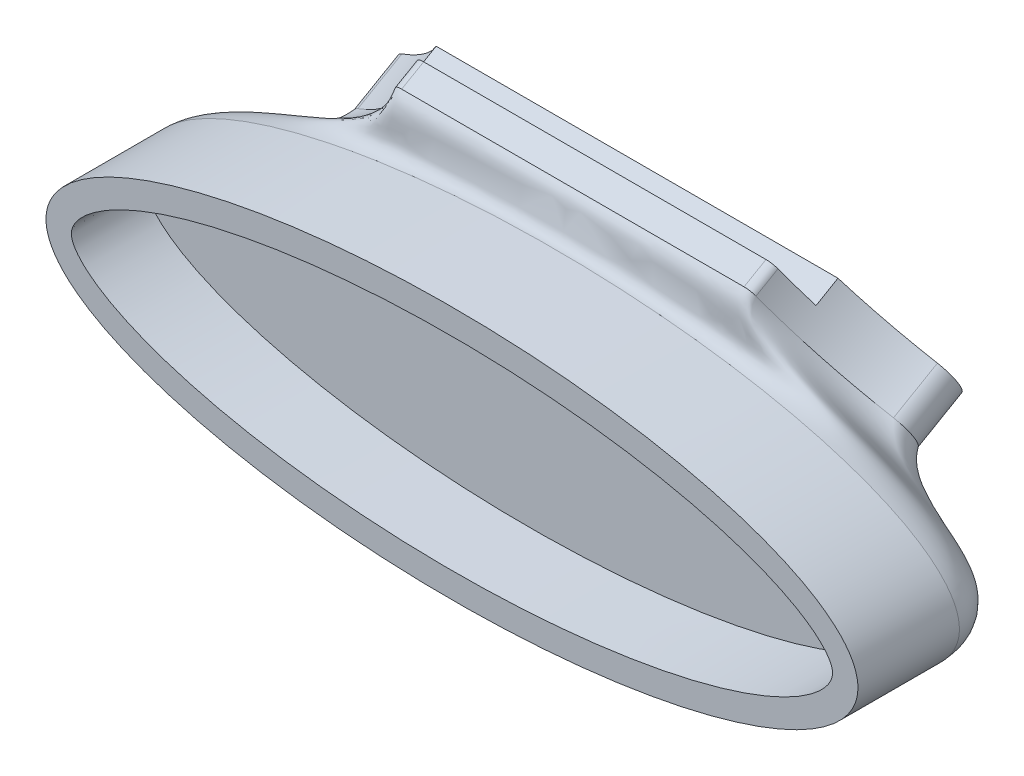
ISO-10303-21;
HEADER;
FILE_DESCRIPTION(('STEP AP214'),'2;1');
FILE_NAME('part.step','',(''),(''),'','','');
FILE_SCHEMA(('AUTOMOTIVE_DESIGN { 1 0 10303 214 1 1 1 1 }'));
ENDSEC;
DATA;
#1=APPLICATION_CONTEXT('core data for automotive mechanical design processes');
#2=APPLICATION_PROTOCOL_DEFINITION('international standard','automotive_design',2000,#1);
#3=PRODUCT_CONTEXT('',#1,'mechanical');
#4=PRODUCT('Part','Part','',(#3));
#5=PRODUCT_RELATED_PRODUCT_CATEGORY('part','',(#4));
#6=PRODUCT_DEFINITION_FORMATION('','',#4);
#7=PRODUCT_DEFINITION_CONTEXT('part definition',#1,'design');
#8=PRODUCT_DEFINITION('design','',#6,#7);
#9=PRODUCT_DEFINITION_SHAPE('','',#8);
#10=(LENGTH_UNIT() NAMED_UNIT(*) SI_UNIT(.MILLI.,.METRE.));
#11=(NAMED_UNIT(*) PLANE_ANGLE_UNIT() SI_UNIT($,.RADIAN.));
#12=(NAMED_UNIT(*) SI_UNIT($,.STERADIAN.) SOLID_ANGLE_UNIT());
#13=UNCERTAINTY_MEASURE_WITH_UNIT(LENGTH_MEASURE(1.E-05),#10,'distance_accuracy_value','');
#14=(GEOMETRIC_REPRESENTATION_CONTEXT(3) GLOBAL_UNCERTAINTY_ASSIGNED_CONTEXT((#13)) GLOBAL_UNIT_ASSIGNED_CONTEXT((#10,
#11,#12)) REPRESENTATION_CONTEXT('',''));
#15=CARTESIAN_POINT('',(0.,0.,0.));
#16=DIRECTION('',(0.,0.,1.));
#17=DIRECTION('',(1.,0.,0.));
#18=AXIS2_PLACEMENT_3D('',#15,#16,#17);
#19=CARTESIAN_POINT('',(0.,0.,20.));
#20=DIRECTION('',(0.,0.,1.));
#21=DIRECTION('',(-1.,0.,0.));
#22=AXIS2_PLACEMENT_3D('',#19,#20,#21);
#23=ELLIPSE('',#22,80.,25.);
#24=DIRECTION('',(0.,0.,-1.));
#25=VECTOR('',#24,1.);
#26=SURFACE_OF_LINEAR_EXTRUSION('',#23,#25);
#27=CARTESIAN_POINT('',(-80.,0.,20.));
#28=VERTEX_POINT('',#27);
#29=EDGE_CURVE('E13',#28,#28,#23,.T.);
#30=ORIENTED_EDGE('',*,*,#29,.F.);
#31=EDGE_LOOP('',(#30));
#32=FACE_BOUND('',#31,.T.);
#33=CARTESIAN_POINT('',(0.,0.,0.));
#34=DIRECTION('',(0.,0.,1.));
#35=DIRECTION('',(-1.,0.,0.));
#36=AXIS2_PLACEMENT_3D('',#33,#34,#35);
#37=ELLIPSE('',#36,80.,25.);
#38=CARTESIAN_POINT('',(-66.1749611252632,-14.0481681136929,0.));
#39=VERTEX_POINT('',#38);
#40=CARTESIAN_POINT('',(66.1749640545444,-14.0481744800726,0.));
#41=VERTEX_POINT('',#40);
#42=EDGE_CURVE('E281',#39,#41,#37,.T.);
#43=ORIENTED_EDGE('',*,*,#42,.T.);
#44=CARTESIAN_POINT('',(0.,0.,0.));
#45=DIRECTION('',(0.,0.,-1.));
#46=DIRECTION('',(-1.,0.,0.));
#47=AXIS2_PLACEMENT_3D('',#44,#45,#46);
#48=ELLIPSE('',#47,80.,25.);
#49=CARTESIAN_POINT('',(34.7690886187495,22.5155371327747,0.));
#50=VERTEX_POINT('',#49);
#51=EDGE_CURVE('E288',#50,#41,#48,.T.);
#52=ORIENTED_EDGE('',*,*,#51,.F.);
#53=CARTESIAN_POINT('',(0.,0.,0.));
#54=DIRECTION('',(0.,0.,-1.));
#55=DIRECTION('',(-1.,0.,0.));
#56=AXIS2_PLACEMENT_3D('',#53,#54,#55);
#57=ELLIPSE('',#56,80.,25.);
#58=CARTESIAN_POINT('',(-34.7690879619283,22.5155327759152,0.));
#59=VERTEX_POINT('',#58);
#60=EDGE_CURVE('E529',#59,#50,#57,.T.);
#61=ORIENTED_EDGE('',*,*,#60,.F.);
#62=CARTESIAN_POINT('',(0.,0.,0.));
#63=DIRECTION('',(0.,0.,-1.));
#64=DIRECTION('',(-1.,0.,0.));
#65=AXIS2_PLACEMENT_3D('',#62,#63,#64);
#66=ELLIPSE('',#65,80.,25.);
#67=EDGE_CURVE('E533',#39,#59,#66,.T.);
#68=ORIENTED_EDGE('',*,*,#67,.F.);
#69=EDGE_LOOP('',(#43,#52,#61,#68));
#70=FACE_BOUND('',#69,.T.);
#71=ADVANCED_FACE('F270',(#32,#70),#26,.F.);
#72=CARTESIAN_POINT('',(0.,0.,20.));
#73=DIRECTION('',(0.,0.,1.));
#74=DIRECTION('',(1.,0.,0.));
#75=AXIS2_PLACEMENT_3D('',#72,#73,#74);
#76=PLANE('',#75);
#77=CARTESIAN_POINT('',(75.,0.,20.));
#78=CARTESIAN_POINT('',(75.0001220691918,0.107766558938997,20.));
#79=CARTESIAN_POINT('',(74.9937583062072,0.215393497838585,20.));
#80=CARTESIAN_POINT('',(74.9695112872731,0.428412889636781,20.));
#81=CARTESIAN_POINT('',(74.9517289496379,0.533816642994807,20.));
#82=CARTESIAN_POINT('',(74.9059719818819,0.742712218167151,20.));
#83=CARTESIAN_POINT('',(74.8779620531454,0.846196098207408,20.));
#84=CARTESIAN_POINT('',(74.8133323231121,1.05097647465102,20.));
#85=CARTESIAN_POINT('',(74.7766693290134,1.15225911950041,20.));
#86=CARTESIAN_POINT('',(74.6965571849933,1.35169282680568,20.));
#87=CARTESIAN_POINT('',(74.6531302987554,1.44985293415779,20.));
#88=CARTESIAN_POINT('',(74.5606279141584,1.64288528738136,20.));
#89=CARTESIAN_POINT('',(74.5115802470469,1.73777094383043,20.));
#90=CARTESIAN_POINT('',(74.4085102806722,1.92464602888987,20.));
#91=CARTESIAN_POINT('',(74.3544936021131,2.01663857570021,20.));
#92=CARTESIAN_POINT('',(74.2422559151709,2.19817508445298,20.));
#93=CARTESIAN_POINT('',(74.1840294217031,2.28771563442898,20.));
#94=CARTESIAN_POINT('',(74.063974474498,2.46466627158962,20.));
#95=CARTESIAN_POINT('',(74.0021374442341,2.55207052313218,20.));
#96=CARTESIAN_POINT('',(73.8752290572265,2.72465365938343,20.));
#97=CARTESIAN_POINT('',(73.8101539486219,2.80982977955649,20.));
#98=CARTESIAN_POINT('',(73.6773211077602,2.97789851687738,20.));
#99=CARTESIAN_POINT('',(73.6095665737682,3.06079366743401,20.));
#100=CARTESIAN_POINT('',(73.4718870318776,3.22421014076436,20.));
#101=CARTESIAN_POINT('',(73.4019713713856,3.30473936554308,20.));
#102=CARTESIAN_POINT('',(73.1897763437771,3.54264779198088,20.));
#103=CARTESIAN_POINT('',(73.0443448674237,3.69722725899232,20.));
#104=CARTESIAN_POINT('',(72.7469054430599,3.99904319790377,20.));
#105=CARTESIAN_POINT('',(72.5949164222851,4.14629846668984,20.));
#106=CARTESIAN_POINT('',(72.2854597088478,4.43471654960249,20.));
#107=CARTESIAN_POINT('',(72.1279955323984,4.57588314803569,20.));
#108=CARTESIAN_POINT('',(71.808119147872,4.85272560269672,20.));
#109=CARTESIAN_POINT('',(71.6457033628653,4.98839731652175,20.));
#110=CARTESIAN_POINT('',(71.3163983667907,5.25477661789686,20.));
#111=CARTESIAN_POINT('',(71.1495019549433,5.3854752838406,20.));
#112=CARTESIAN_POINT('',(70.8117510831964,5.64248012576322,20.));
#113=CARTESIAN_POINT('',(70.6408882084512,5.76877520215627,20.));
#114=CARTESIAN_POINT('',(70.1231522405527,6.14159498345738,20.));
#115=CARTESIAN_POINT('',(69.7716160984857,6.38166751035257,20.));
#116=CARTESIAN_POINT('',(69.0606353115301,6.84538886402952,20.));
#117=CARTESIAN_POINT('',(68.7012430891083,7.0691187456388,20.));
#118=CARTESIAN_POINT('',(67.9762268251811,7.50288891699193,20.));
#119=CARTESIAN_POINT('',(67.6106327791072,7.7129794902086,20.));
#120=CARTESIAN_POINT('',(66.8739288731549,8.12108338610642,20.));
#121=CARTESIAN_POINT('',(66.5028342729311,8.31912435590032,20.));
#122=CARTESIAN_POINT('',(65.3826293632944,8.89688609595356,20.));
#123=CARTESIAN_POINT('',(64.6254251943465,9.26093635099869,20.));
#124=CARTESIAN_POINT('',(63.0960960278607,9.95600140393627,20.));
#125=CARTESIAN_POINT('',(62.323969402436,10.287012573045,20.));
#126=CARTESIAN_POINT('',(60.7665960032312,10.920308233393,20.));
#127=CARTESIAN_POINT('',(59.9813299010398,11.2225450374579,20.));
#128=CARTESIAN_POINT('',(58.3994956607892,11.8030403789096,20.));
#129=CARTESIAN_POINT('',(57.6029016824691,12.0812280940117,20.));
#130=CARTESIAN_POINT('',(56.0020488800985,12.6153092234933,20.));
#131=CARTESIAN_POINT('',(55.1977878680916,12.8711960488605,20.));
#132=CARTESIAN_POINT('',(52.7835338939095,13.606747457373,20.));
#133=CARTESIAN_POINT('',(51.164550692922,14.0570033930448,20.));
#134=CARTESIAN_POINT('',(47.9174846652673,14.8907493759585,20.));
#135=CARTESIAN_POINT('',(46.2894752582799,15.274529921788,20.));
#136=CARTESIAN_POINT('',(43.0254019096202,15.9848432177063,20.));
#137=CARTESIAN_POINT('',(41.3893688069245,16.3115184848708,20.));
#138=CARTESIAN_POINT('',(38.110447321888,16.9160069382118,20.));
#139=CARTESIAN_POINT('',(36.4675698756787,17.193879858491,20.));
#140=CARTESIAN_POINT('',(33.1755148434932,17.7049227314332,20.));
#141=CARTESIAN_POINT('',(31.5263396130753,17.9381079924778,20.));
#142=CARTESIAN_POINT('',(26.5685972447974,18.5772487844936,20.));
#143=CARTESIAN_POINT('',(23.2520749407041,18.9223843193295,20.));
#144=CARTESIAN_POINT('',(16.5988868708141,19.4689613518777,20.));
#145=CARTESIAN_POINT('',(13.2621911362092,19.6700261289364,20.));
#146=CARTESIAN_POINT('',(6.57275939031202,19.936508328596,20.));
#147=CARTESIAN_POINT('',(3.22000618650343,20.0014904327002,20.));
#148=CARTESIAN_POINT('',(-3.4754741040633,19.9984439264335,20.));
#149=CARTESIAN_POINT('',(-6.81820133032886,19.9308106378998,20.));
#150=CARTESIAN_POINT('',(-13.4878699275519,19.6585673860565,20.));
#151=CARTESIAN_POINT('',(-16.8148283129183,19.4543769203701,20.));
#152=CARTESIAN_POINT('',(-23.4525443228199,18.9025777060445,20.));
#153=CARTESIAN_POINT('',(-26.7633180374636,18.5551686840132,20.));
#154=CARTESIAN_POINT('',(-31.7139611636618,17.9122653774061,20.));
#155=CARTESIAN_POINT('',(-33.3618395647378,17.6776208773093,20.));
#156=CARTESIAN_POINT('',(-36.65246936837,17.1633794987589,20.));
#157=CARTESIAN_POINT('',(-38.29521321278,16.8837338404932,20.));
#158=CARTESIAN_POINT('',(-41.5751515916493,16.2752444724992,20.));
#159=CARTESIAN_POINT('',(-43.2123275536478,15.9462999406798,20.));
#160=CARTESIAN_POINT('',(-46.4801454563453,15.2306742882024,20.));
#161=CARTESIAN_POINT('',(-48.1107438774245,14.8437932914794,20.));
#162=CARTESIAN_POINT('',(-51.3645716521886,14.0026467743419,20.));
#163=CARTESIAN_POINT('',(-52.9877072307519,13.5480126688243,20.));
#164=CARTESIAN_POINT('',(-55.4051708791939,12.8059060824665,20.));
#165=CARTESIAN_POINT('',(-56.208697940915,12.5483016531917,20.));
#166=CARTESIAN_POINT('',(-57.8064833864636,12.010967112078,20.));
#167=CARTESIAN_POINT('',(-58.6007576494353,11.731284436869,20.));
#168=CARTESIAN_POINT('',(-60.1789788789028,11.1472731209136,20.));
#169=CARTESIAN_POINT('',(-60.9629387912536,10.8429796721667,20.));
#170=CARTESIAN_POINT('',(-62.5184505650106,10.2047704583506,20.));
#171=CARTESIAN_POINT('',(-63.2900063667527,9.87086432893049,20.));
#172=CARTESIAN_POINT('',(-64.8190629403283,9.16897247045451,20.));
#173=CARTESIAN_POINT('',(-65.576540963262,8.80093651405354,20.));
#174=CARTESIAN_POINT('',(-66.6971501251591,8.21612203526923,20.));
#175=CARTESIAN_POINT('',(-67.0686599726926,8.0153804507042,20.));
#176=CARTESIAN_POINT('',(-67.8063870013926,7.60124815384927,20.));
#177=CARTESIAN_POINT('',(-68.1725796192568,7.38781353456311,20.));
#178=CARTESIAN_POINT('',(-68.897800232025,6.94743505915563,20.));
#179=CARTESIAN_POINT('',(-69.2568120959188,6.72046454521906,20.));
#180=CARTESIAN_POINT('',(-69.9639845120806,6.25122885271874,20.));
#181=CARTESIAN_POINT('',(-70.3121610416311,6.00898795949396,20.));
#182=CARTESIAN_POINT('',(-70.8246414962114,5.63269933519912,20.));
#183=CARTESIAN_POINT('',(-70.9937582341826,5.50517998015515,20.));
#184=CARTESIAN_POINT('',(-71.3283366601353,5.24523907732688,20.));
#185=CARTESIAN_POINT('',(-71.4937964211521,5.1128150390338,20.));
#186=CARTESIAN_POINT('',(-71.8204987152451,4.84237396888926,20.));
#187=CARTESIAN_POINT('',(-71.9817347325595,4.7043490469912,20.));
#188=CARTESIAN_POINT('',(-72.2994821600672,4.4220731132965,20.));
#189=CARTESIAN_POINT('',(-72.4559790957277,4.27780576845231,20.));
#190=CARTESIAN_POINT('',(-72.7630447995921,3.98290679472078,20.));
#191=CARTESIAN_POINT('',(-72.9136102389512,3.8322716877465,20.));
#192=CARTESIAN_POINT('',(-73.2069405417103,3.52396323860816,20.));
#193=CARTESIAN_POINT('',(-73.349716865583,3.36630089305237,20.));
#194=CARTESIAN_POINT('',(-73.5570863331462,3.12379645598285,20.));
#195=CARTESIAN_POINT('',(-73.6251290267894,3.04189144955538,20.));
#196=CARTESIAN_POINT('',(-73.7586560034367,2.87586065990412,20.));
#197=CARTESIAN_POINT('',(-73.8241372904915,2.79173245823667,20.));
#198=CARTESIAN_POINT('',(-73.9520165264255,2.62132165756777,20.));
#199=CARTESIAN_POINT('',(-74.0144181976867,2.53504185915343,20.));
#200=CARTESIAN_POINT('',(-74.1355675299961,2.36036107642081,20.));
#201=CARTESIAN_POINT('',(-74.1943263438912,2.27196784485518,20.));
#202=CARTESIAN_POINT('',(-74.3078448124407,2.09311256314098,20.));
#203=CARTESIAN_POINT('',(-74.3626188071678,2.00265964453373,20.));
#204=CARTESIAN_POINT('',(-74.4675151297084,1.81932575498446,20.));
#205=CARTESIAN_POINT('',(-74.5176468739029,1.7264502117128,20.));
#206=CARTESIAN_POINT('',(-74.6123917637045,1.53782130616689,20.));
#207=CARTESIAN_POINT('',(-74.6570007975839,1.44206586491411,20.));
#208=CARTESIAN_POINT('',(-74.7400019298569,1.24730285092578,20.));
#209=CARTESIAN_POINT('',(-74.7783613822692,1.14828125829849,20.));
#210=CARTESIAN_POINT('',(-74.8477063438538,0.94658595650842,20.));
#211=CARTESIAN_POINT('',(-74.878617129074,0.843886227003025,20.));
#212=CARTESIAN_POINT('',(-74.9309435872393,0.636155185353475,20.));
#213=CARTESIAN_POINT('',(-74.9523692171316,0.531126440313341,20.));
#214=CARTESIAN_POINT('',(-74.9837611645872,0.320050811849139,20.));
#215=CARTESIAN_POINT('',(-74.993803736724,0.214015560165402,20.));
#216=CARTESIAN_POINT('',(-75.001946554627,0.000812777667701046,20.));
#217=CARTESIAN_POINT('',(-74.9999722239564,-0.10635769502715,20.));
#218=CARTESIAN_POINT('',(-74.9838919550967,-0.320161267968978,20.));
#219=CARTESIAN_POINT('',(-74.9697406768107,-0.42679085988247,20.));
#220=CARTESIAN_POINT('',(-74.9308229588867,-0.637704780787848,20.));
#221=CARTESIAN_POINT('',(-74.9060888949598,-0.741995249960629,20.));
#222=CARTESIAN_POINT('',(-74.8475671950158,-0.948043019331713,20.));
#223=CARTESIAN_POINT('',(-74.813773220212,-1.0497984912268,20.));
#224=CARTESIAN_POINT('',(-74.7386411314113,-1.25056287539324,20.));
#225=CARTESIAN_POINT('',(-74.6972953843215,-1.34956889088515,20.));
#226=CARTESIAN_POINT('',(-74.6087294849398,-1.54448633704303,20.));
#227=CARTESIAN_POINT('',(-74.5615297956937,-1.64040714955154,20.));
#228=CARTESIAN_POINT('',(-74.4621273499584,-1.8291091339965,20.));
#229=CARTESIAN_POINT('',(-74.4099457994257,-1.92190152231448,20.));
#230=CARTESIAN_POINT('',(-74.3011647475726,-2.10471011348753,20.));
#231=CARTESIAN_POINT('',(-74.2445700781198,-2.19472920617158,20.));
#232=CARTESIAN_POINT('',(-74.1276015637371,-2.37239276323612,20.));
#233=CARTESIAN_POINT('',(-74.067224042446,-2.46003479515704,20.));
#234=CARTESIAN_POINT('',(-73.9431650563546,-2.63328366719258,20.));
#235=CARTESIAN_POINT('',(-73.8794754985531,-2.71888469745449,20.));
#236=CARTESIAN_POINT('',(-73.7491030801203,-2.8880107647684,20.));
#237=CARTESIAN_POINT('',(-73.6824151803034,-2.97153191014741,20.));
#238=CARTESIAN_POINT('',(-73.5465526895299,-3.136427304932,20.));
#239=CARTESIAN_POINT('',(-73.4773798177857,-3.21780297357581,20.));
#240=CARTESIAN_POINT('',(-73.3370200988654,-3.37830703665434,20.));
#241=CARTESIAN_POINT('',(-73.2658408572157,-3.45744210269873,20.));
#242=CARTESIAN_POINT('',(-73.0500920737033,-3.69128424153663,20.));
#243=CARTESIAN_POINT('',(-72.9025887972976,-3.84329549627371,20.));
#244=CARTESIAN_POINT('',(-72.6015557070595,-4.14014714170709,20.));
#245=CARTESIAN_POINT('',(-72.4480477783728,-4.28500988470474,20.));
#246=CARTESIAN_POINT('',(-72.135988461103,-4.56875203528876,20.));
#247=CARTESIAN_POINT('',(-71.9774441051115,-4.70763919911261,20.));
#248=CARTESIAN_POINT('',(-71.6557954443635,-4.98001646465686,20.));
#249=CARTESIAN_POINT('',(-71.4926911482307,-5.11350657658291,20.));
#250=CARTESIAN_POINT('',(-71.1623552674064,-5.37560231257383,20.));
#251=CARTESIAN_POINT('',(-70.9951198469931,-5.50420309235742,20.));
#252=CARTESIAN_POINT('',(-70.65699005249,-5.75707158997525,20.));
#253=CARTESIAN_POINT('',(-70.4860901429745,-5.88133187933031,20.));
#254=CARTESIAN_POINT('',(-69.9679822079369,-6.24861720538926,20.));
#255=CARTESIAN_POINT('',(-69.6163275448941,-6.48539309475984,20.));
#256=CARTESIAN_POINT('',(-68.9038925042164,-6.9439311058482,20.));
#257=CARTESIAN_POINT('',(-68.5431207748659,-7.16570677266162,20.));
#258=CARTESIAN_POINT('',(-67.8160010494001,-7.59558135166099,20.));
#259=CARTESIAN_POINT('',(-67.449690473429,-7.80374374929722,20.));
#260=CARTESIAN_POINT('',(-66.7120063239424,-8.20804379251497,20.));
#261=CARTESIAN_POINT('',(-66.3406522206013,-8.40421708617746,20.));
#262=CARTESIAN_POINT('',(-65.2206501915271,-8.97627205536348,20.));
#263=CARTESIAN_POINT('',(-64.4641498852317,-9.33680236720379,20.));
#264=CARTESIAN_POINT('',(-62.9374987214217,-10.0249853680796,20.));
#265=CARTESIAN_POINT('',(-62.1673633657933,-10.3526728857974,20.));
#266=CARTESIAN_POINT('',(-60.6150709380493,-10.9794786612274,20.));
#267=CARTESIAN_POINT('',(-59.8329071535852,-11.2785802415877,20.));
#268=CARTESIAN_POINT('',(-58.2585219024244,-11.8529089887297,20.));
#269=CARTESIAN_POINT('',(-57.4662865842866,-12.1280979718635,20.));
#270=CARTESIAN_POINT('',(-55.8727810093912,-12.6570249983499,20.));
#271=CARTESIAN_POINT('',(-55.0714946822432,-12.9107144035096,20.));
#272=CARTESIAN_POINT('',(-52.6591933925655,-13.6423014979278,20.));
#273=CARTESIAN_POINT('',(-51.0392586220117,-14.0908886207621,20.));
#274=CARTESIAN_POINT('',(-47.7919027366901,-14.921135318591,20.));
#275=CARTESIAN_POINT('',(-46.1645693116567,-15.3031432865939,20.));
#276=CARTESIAN_POINT('',(-42.9035803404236,-16.0098261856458,20.));
#277=CARTESIAN_POINT('',(-41.269967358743,-16.3346986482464,20.));
#278=CARTESIAN_POINT('',(-37.9973957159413,-16.9356071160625,20.));
#279=CARTESIAN_POINT('',(-36.3584555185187,-17.2117443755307,20.));
#280=CARTESIAN_POINT('',(-33.0756494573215,-17.7194376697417,20.));
#281=CARTESIAN_POINT('',(-31.4317913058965,-17.9510440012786,20.));
#282=CARTESIAN_POINT('',(-26.4936291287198,-18.58536633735,20.));
#283=CARTESIAN_POINT('',(-23.1914764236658,-18.9278106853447,20.));
#284=CARTESIAN_POINT('',(-16.571643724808,-19.4707411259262,20.));
#285=CARTESIAN_POINT('',(-13.2539493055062,-19.6710457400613,20.));
#286=CARTESIAN_POINT('',(-6.60341070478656,-19.9364060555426,20.));
#287=CARTESIAN_POINT('',(-3.27055067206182,-20.0010620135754,20.));
#288=CARTESIAN_POINT('',(3.40679916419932,-19.9989187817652,20.));
#289=CARTESIAN_POINT('',(6.75128878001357,-19.9316579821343,20.));
#290=CARTESIAN_POINT('',(13.4338043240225,-19.6608026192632,20.));
#291=CARTESIAN_POINT('',(16.7718318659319,-19.4572482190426,20.));
#292=CARTESIAN_POINT('',(23.4381881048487,-18.904465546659,20.));
#293=CARTESIAN_POINT('',(26.766509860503,-18.5551507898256,20.));
#294=CARTESIAN_POINT('',(31.742817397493,-17.9083168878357,20.));
#295=CARTESIAN_POINT('',(33.3989034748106,-17.6722263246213,20.));
#296=CARTESIAN_POINT('',(36.7037446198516,-17.1549520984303,20.));
#297=CARTESIAN_POINT('',(38.3525010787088,-16.8737774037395,20.));
#298=CARTESIAN_POINT('',(41.6418407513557,-16.2621695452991,20.));
#299=CARTESIAN_POINT('',(43.2824190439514,-15.9317097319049,20.));
#300=CARTESIAN_POINT('',(46.5511163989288,-15.2141203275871,20.));
#301=CARTESIAN_POINT('',(48.1792361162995,-14.8269937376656,20.));
#302=CARTESIAN_POINT('',(51.4187784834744,-13.9876980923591,20.));
#303=CARTESIAN_POINT('',(53.0302021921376,-13.5355331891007,20.));
#304=CARTESIAN_POINT('',(55.4295607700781,-12.7981259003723,20.));
#305=CARTESIAN_POINT('',(56.2265947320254,-12.5423872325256,20.));
#306=CARTESIAN_POINT('',(57.8128501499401,-12.0087094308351,20.));
#307=CARTESIAN_POINT('',(58.6020748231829,-11.7307799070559,20.));
#308=CARTESIAN_POINT('',(60.1716505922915,-11.1500023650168,20.));
#309=CARTESIAN_POINT('',(60.9519986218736,-10.8471460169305,20.));
#310=CARTESIAN_POINT('',(62.5008788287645,-10.2122015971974,20.));
#311=CARTESIAN_POINT('',(63.2694094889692,-9.88010980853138,20.));
#312=CARTESIAN_POINT('',(64.79071679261,-9.18219092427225,20.));
#313=CARTESIAN_POINT('',(65.5435012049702,-8.81638097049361,20.));
#314=CARTESIAN_POINT('',(66.6569534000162,-8.23663754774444,20.));
#315=CARTESIAN_POINT('',(67.0256627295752,-8.0381119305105,20.));
#316=CARTESIAN_POINT('',(67.7564439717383,-7.62954131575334,20.));
#317=CARTESIAN_POINT('',(68.1185189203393,-7.41950177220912,20.));
#318=CARTESIAN_POINT('',(68.8341480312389,-6.98704998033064,20.));
#319=CARTESIAN_POINT('',(69.1877190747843,-6.76466575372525,20.));
#320=CARTESIAN_POINT('',(69.8846580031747,-6.30521993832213,20.));
#321=CARTESIAN_POINT('',(70.2280377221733,-6.06817644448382,20.));
#322=CARTESIAN_POINT('',(70.7341371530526,-5.700013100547,20.));
#323=CARTESIAN_POINT('',(70.9014141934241,-5.57513407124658,20.));
#324=CARTESIAN_POINT('',(71.2326745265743,-5.32056043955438,20.));
#325=CARTESIAN_POINT('',(71.3966525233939,-5.19085891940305,20.));
#326=CARTESIAN_POINT('',(71.7206755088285,-4.92610951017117,20.));
#327=CARTESIAN_POINT('',(71.8807138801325,-4.79105350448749,20.));
#328=CARTESIAN_POINT('',(72.1962577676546,-4.51510431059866,20.));
#329=CARTESIAN_POINT('',(72.3517535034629,-4.37419991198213,20.));
#330=CARTESIAN_POINT('',(72.6571404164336,-4.0863828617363,20.));
#331=CARTESIAN_POINT('',(72.8070308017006,-3.93946936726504,20.));
#332=CARTESIAN_POINT('',(73.0996609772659,-3.63892780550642,20.));
#333=CARTESIAN_POINT('',(73.2424079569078,-3.48530679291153,20.));
#334=CARTESIAN_POINT('',(73.450307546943,-3.24916862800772,20.));
#335=CARTESIAN_POINT('',(73.5186294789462,-3.16943020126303,20.));
#336=CARTESIAN_POINT('',(73.6529505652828,-3.00784932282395,20.));
#337=CARTESIAN_POINT('',(73.7189467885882,-2.92600442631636,20.));
#338=CARTESIAN_POINT('',(73.8481397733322,-2.76028408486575,20.));
#339=CARTESIAN_POINT('',(73.9113397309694,-2.67641113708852,20.));
#340=CARTESIAN_POINT('',(74.03442752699,-2.50668010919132,20.));
#341=CARTESIAN_POINT('',(74.0943254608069,-2.42082936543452,20.));
#342=CARTESIAN_POINT('',(74.2104796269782,-2.24719462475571,20.));
#343=CARTESIAN_POINT('',(74.266749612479,-2.15941985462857,20.));
#344=CARTESIAN_POINT('',(74.3751110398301,-1.98164083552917,20.));
#345=CARTESIAN_POINT('',(74.4272134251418,-1.8916432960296,20.));
#346=CARTESIAN_POINT('',(74.5265454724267,-1.70904800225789,20.));
#347=CARTESIAN_POINT('',(74.5737778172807,-1.61645171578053,20.));
#348=CARTESIAN_POINT('',(74.6627806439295,-1.42834385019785,20.));
#349=CARTESIAN_POINT('',(74.7045357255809,-1.33282494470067,20.));
#350=CARTESIAN_POINT('',(74.7818581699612,-1.13820400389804,20.));
#351=CARTESIAN_POINT('',(74.8173610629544,-1.03907607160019,20.));
#352=CARTESIAN_POINT('',(74.8804058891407,-0.837455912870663,20.));
#353=CARTESIAN_POINT('',(74.9078855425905,-0.734943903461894,20.));
#354=CARTESIAN_POINT('',(74.9528210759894,-0.52780975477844,20.));
#355=CARTESIAN_POINT('',(74.9702883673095,-0.423190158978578,20.));
#356=CARTESIAN_POINT('',(74.993968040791,-0.212427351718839,20.));
#357=CARTESIAN_POINT('',(75.0001506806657,-0.106280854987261,20.));
#358=CARTESIAN_POINT('',(75.,0.,20.));
#359=B_SPLINE_CURVE_WITH_KNOTS('',3,(#77,#78,#79,#80,#81,#82,#83,#84,#85,#86,#87,#88,#89,#90,
#91,#92,#93,#94,#95,#96,#97,#98,#99,#100,#101,#102,#103,#104,#105,#106,#107,#108,#109,#110,#111,
#112,#113,#114,#115,#116,#117,#118,#119,#120,#121,#122,#123,#124,#125,#126,#127,#128,#129,#130,
#131,#132,#133,#134,#135,#136,#137,#138,#139,#140,#141,#142,#143,#144,#145,#146,#147,#148,#149,
#150,#151,#152,#153,#154,#155,#156,#157,#158,#159,#160,#161,#162,#163,#164,#165,#166,#167,#168,
#169,#170,#171,#172,#173,#174,#175,#176,#177,#178,#179,#180,#181,#182,#183,#184,#185,#186,#187,
#188,#189,#190,#191,#192,#193,#194,#195,#196,#197,#198,#199,#200,#201,#202,#203,#204,#205,#206,
#207,#208,#209,#210,#211,#212,#213,#214,#215,#216,#217,#218,#219,#220,#221,#222,#223,#224,#225,
#226,#227,#228,#229,#230,#231,#232,#233,#234,#235,#236,#237,#238,#239,#240,#241,#242,#243,#244,
#245,#246,#247,#248,#249,#250,#251,#252,#253,#254,#255,#256,#257,#258,#259,#260,#261,#262,#263,
#264,#265,#266,#267,#268,#269,#270,#271,#272,#273,#274,#275,#276,#277,#278,#279,#280,#281,#282,
#283,#284,#285,#286,#287,#288,#289,#290,#291,#292,#293,#294,#295,#296,#297,#298,#299,#300,#301,
#302,#303,#304,#305,#306,#307,#308,#309,#310,#311,#312,#313,#314,#315,#316,#317,#318,#319,#320,
#321,#322,#323,#324,#325,#326,#327,#328,#329,#330,#331,#332,#333,#334,#335,#336,#337,#338,#339,
#340,#341,#342,#343,#344,#345,#346,#347,#348,#349,#350,#351,#352,#353,#354,#355,#356,#357,#358),
.UNSPECIFIED.,.F.,.F.,(4,2,2,2,2,2,2,2,2,2,2,2,2,2,2,2,2,2,2,2,2,2,2,2,2,2,2,2,2,2,2,2,2,2,2,2,
2,2,2,2,2,2,2,2,2,2,2,2,2,2,2,2,2,2,2,2,2,2,2,2,2,2,2,2,2,2,2,2,2,2,2,2,2,2,2,2,2,2,2,2,2,2,2,2,
2,2,2,2,2,2,2,2,2,2,2,2,2,2,2,2,2,2,2,2,2,2,2,2,2,2,2,2,2,2,2,2,2,2,2,2,2,2,2,2,2,2,2,2,2,2,2,2,
2,2,2,2,2,2,2,2,4),(0.,0.322895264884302,0.642975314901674,0.964170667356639,1.28700454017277,
1.60879741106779,1.92906067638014,2.24896602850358,2.56929597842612,2.89042051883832,
3.21192621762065,3.53305909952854,3.85295719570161,4.4893781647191,5.12407124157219,
5.75836397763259,6.39312630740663,7.02897831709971,7.66633161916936,8.94289527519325,
10.2126238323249,11.4773688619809,12.7390931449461,15.2584651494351,17.7781135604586,
20.301867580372,22.8328171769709,25.3645120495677,30.4039619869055,35.4208011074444,
40.4249352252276,45.4229009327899,50.4191514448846,60.4185369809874,70.4439747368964,
80.5014344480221,90.5289588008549,100.525819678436,110.508786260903,115.501793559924,
120.500250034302,125.509072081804,130.535590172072,135.590525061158,138.121683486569,
140.647544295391,143.169855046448,145.691348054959,148.216612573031,149.483255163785,
150.754567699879,152.028472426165,153.300399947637,153.935750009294,154.571427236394,
155.20803335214,155.84641987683,156.485159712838,157.12293288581,157.442334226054,
157.762098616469,158.081466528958,158.399802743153,158.716930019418,159.033399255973,
159.350102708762,159.668410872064,159.989790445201,160.310831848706,160.629709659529,
160.950568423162,161.272627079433,161.593707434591,161.915013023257,162.236645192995,
162.557183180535,162.876412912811,163.195297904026,163.514497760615,163.834518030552,
164.155097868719,164.475460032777,164.794738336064,165.429912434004,166.062954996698,
166.6951494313,167.327342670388,167.960146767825,168.593985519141,169.865324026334,
171.135498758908,172.399250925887,173.659041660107,176.171993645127,178.682251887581,
181.193965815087,183.709619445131,186.230820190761,191.271702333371,196.285358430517,
201.281324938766,206.266786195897,211.246582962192,221.202338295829,231.170781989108,
241.168560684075,251.201386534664,261.231257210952,271.26708743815,276.285080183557,
281.302075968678,286.321794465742,291.341247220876,296.360379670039,298.871288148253,
301.381115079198,303.891784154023,306.402772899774,308.912492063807,310.168600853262,
311.424119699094,312.676896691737,313.928157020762,314.554343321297,315.181465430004,
315.809577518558,316.438954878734,317.068420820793,317.697239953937,318.012218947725,
318.327581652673,318.642574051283,318.956542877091,319.269241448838,319.581089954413,
319.892765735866,320.205299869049,320.520888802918,320.838866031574,321.156480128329,
321.474930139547),.UNSPECIFIED.);
#360=CARTESIAN_POINT('',(75.,0.,20.));
#361=VERTEX_POINT('',#360);
#362=EDGE_CURVE('E532',#361,#361,#359,.T.);
#363=ORIENTED_EDGE('',*,*,#362,.F.);
#364=EDGE_LOOP('',(#363));
#365=FACE_BOUND('',#364,.T.);
#366=ORIENTED_EDGE('',*,*,#29,.T.);
#367=EDGE_LOOP('',(#366));
#368=FACE_BOUND('',#367,.T.);
#369=ADVANCED_FACE('F614',(#365,#368),#76,.T.);
#370=CARTESIAN_POINT('',(75.,0.,5.));
#371=CARTESIAN_POINT('',(75.,0.217297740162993,5.));
#372=CARTESIAN_POINT('',(74.9745878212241,0.429660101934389,5.));
#373=CARTESIAN_POINT('',(74.883192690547,0.846505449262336,5.));
#374=CARTESIAN_POINT('',(74.8169394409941,1.05229005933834,5.));
#375=CARTESIAN_POINT('',(74.5757668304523,1.65183089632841,5.));
#376=CARTESIAN_POINT('',(74.3640687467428,2.0221249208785,5.));
#377=CARTESIAN_POINT('',(73.8840838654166,2.73003779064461,5.));
#378=CARTESIAN_POINT('',(73.6140913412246,3.06692880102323,5.));
#379=CARTESIAN_POINT('',(73.047888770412,3.70171532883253,5.));
#380=CARTESIAN_POINT('',(72.7495294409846,4.00223395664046,5.));
#381=CARTESIAN_POINT('',(71.8213588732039,4.86719109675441,5.));
#382=CARTESIAN_POINT('',(71.1589478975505,5.3955759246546,5.));
#383=CARTESIAN_POINT('',(70.1232415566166,6.14160386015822,5.));
#384=CARTESIAN_POINT('',(69.7706533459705,6.3822899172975,5.));
#385=CARTESIAN_POINT('',(69.0596895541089,6.84601124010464,5.));
#386=CARTESIAN_POINT('',(68.7004424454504,7.0696748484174,5.));
#387=CARTESIAN_POINT('',(66.8883410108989,8.15345206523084,5.));
#388=CARTESIAN_POINT('',(65.3894642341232,8.91337253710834,5.));
#389=CARTESIAN_POINT('',(62.3321408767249,10.303527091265,5.));
#390=CARTESIAN_POINT('',(60.7728563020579,10.9319368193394,5.));
#391=CARTESIAN_POINT('',(57.6102210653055,12.092822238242,5.));
#392=CARTESIAN_POINT('',(56.0026836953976,12.6259444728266,5.));
#393=CARTESIAN_POINT('',(52.7783001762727,13.6083657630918,5.));
#394=CARTESIAN_POINT('',(51.1602064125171,14.0582168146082,5.));
#395=CARTESIAN_POINT('',(46.2916890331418,15.3080074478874,5.));
#396=CARTESIAN_POINT('',(43.027207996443,16.0094365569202,5.));
#397=CARTESIAN_POINT('',(36.4705859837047,17.2184616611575,5.));
#398=CARTESIAN_POINT('',(33.1783021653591,17.7250566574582,5.));
#399=CARTESIAN_POINT('',(26.5707328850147,18.577057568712,5.));
#400=CARTESIAN_POINT('',(23.2553987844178,18.9221226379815,5.));
#401=CARTESIAN_POINT('',(16.6042187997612,19.4685119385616,5.));
#402=CARTESIAN_POINT('',(13.2683540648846,19.6697040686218,5.));
#403=CARTESIAN_POINT('',(6.57726268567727,19.9364054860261,5.));
#404=CARTESIAN_POINT('',(3.21681033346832,20.0017360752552,5.));
#405=CARTESIAN_POINT('',(-6.83179130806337,19.996422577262,5.));
#406=CARTESIAN_POINT('',(-13.5003488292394,19.7294421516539,5.));
#407=CARTESIAN_POINT('',(-23.4538170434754,18.9027070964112,5.));
#408=CARTESIAN_POINT('',(-26.7633206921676,18.5552982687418,5.));
#409=CARTESIAN_POINT('',(-33.3635011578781,17.6979219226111,5.));
#410=CARTESIAN_POINT('',(-36.6542196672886,17.1883143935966,5.));
#411=CARTESIAN_POINT('',(-43.2127477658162,15.971294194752,5.));
#412=CARTESIAN_POINT('',(-46.4806811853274,15.26495072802,5.));
#413=CARTESIAN_POINT('',(-51.3592673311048,14.0041329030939,5.));
#414=CARTESIAN_POINT('',(-52.9834612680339,13.5493866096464,5.));
#415=CARTESIAN_POINT('',(-56.2136697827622,12.557644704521,5.));
#416=CARTESIAN_POINT('',(-57.8124741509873,12.0231000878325,5.));
#417=CARTESIAN_POINT('',(-60.9683722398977,10.8550467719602,5.));
#418=CARTESIAN_POINT('',(-62.5256876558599,10.2220640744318,5.));
#419=CARTESIAN_POINT('',(-65.5822389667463,8.8182972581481,5.));
#420=CARTESIAN_POINT('',(-67.0823627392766,8.04961974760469,5.));
#421=CARTESIAN_POINT('',(-69.2610495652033,6.7269629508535,5.));
#422=CARTESIAN_POINT('',(-69.9711631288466,6.25951010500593,5.));
#423=CARTESIAN_POINT('',(-71.3366860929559,5.25658621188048,5.));
#424=CARTESIAN_POINT('',(-71.9942580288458,4.72111398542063,5.));
#425=CARTESIAN_POINT('',(-72.9170751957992,3.8350386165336,5.));
#426=CARTESIAN_POINT('',(-73.2115025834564,3.5279248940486,5.));
#427=CARTESIAN_POINT('',(-73.7642750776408,2.88151152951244,5.));
#428=CARTESIAN_POINT('',(-74.0243416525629,2.54005691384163,5.));
#429=CARTESIAN_POINT('',(-74.478045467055,1.82468323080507,5.));
#430=CARTESIAN_POINT('',(-74.6739390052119,1.45100919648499,5.));
#431=CARTESIAN_POINT('',(-74.8823315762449,0.846372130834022,5.));
#432=CARTESIAN_POINT('',(-74.9367908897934,0.635820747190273,5.));
#433=CARTESIAN_POINT('',(-74.9994456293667,0.214642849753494,5.));
#434=CARTESIAN_POINT('',(-75.0081660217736,0.0019512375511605,5.));
#435=CARTESIAN_POINT('',(-74.9595092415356,-0.643082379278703,5.));
#436=CARTESIAN_POINT('',(-74.8304315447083,-1.05678777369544,5.));
#437=CARTESIAN_POINT('',(-74.4754424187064,-1.83759957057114,5.));
#438=CARTESIAN_POINT('',(-74.2532229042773,-2.20010038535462,5.));
#439=CARTESIAN_POINT('',(-73.7573254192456,-2.89299571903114,5.));
#440=CARTESIAN_POINT('',(-73.4815889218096,-3.22361997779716,5.));
#441=CARTESIAN_POINT('',(-72.9057505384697,-3.84771146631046,5.));
#442=CARTESIAN_POINT('',(-72.6039064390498,-4.14333002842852,5.));
#443=CARTESIAN_POINT('',(-71.6679277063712,-4.99426812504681,5.));
#444=CARTESIAN_POINT('',(-71.0038025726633,-5.51420793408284,5.));
#445=CARTESIAN_POINT('',(-69.6236361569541,-6.4928421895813,5.));
#446=CARTESIAN_POINT('',(-68.9054360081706,-6.95163206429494,5.));
#447=CARTESIAN_POINT('',(-66.7250462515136,-8.24030241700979,5.));
#448=CARTESIAN_POINT('',(-65.2263681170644,-8.99290756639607,5.));
#449=CARTESIAN_POINT('',(-62.1744618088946,-10.369249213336,5.));
#450=CARTESIAN_POINT('',(-60.6204684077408,-10.9911779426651,5.));
#451=CARTESIAN_POINT('',(-57.4721944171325,-12.1398612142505,5.));
#452=CARTESIAN_POINT('',(-55.8777142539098,-12.6661442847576,5.));
#453=CARTESIAN_POINT('',(-53.4619919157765,-13.3988665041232,5.));
#454=CARTESIAN_POINT('',(-52.6525253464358,-13.63359655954,5.));
#455=CARTESIAN_POINT('',(-51.0333688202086,-14.0838695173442,5.));
#456=CARTESIAN_POINT('',(-50.2227470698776,-14.2997000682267,5.));
#457=CARTESIAN_POINT('',(-46.16493184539,-15.3368800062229,5.));
#458=CARTESIAN_POINT('',(-42.9038692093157,-16.0345427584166,5.));
#459=CARTESIAN_POINT('',(-36.3600495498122,-17.2363954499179,5.));
#460=CARTESIAN_POINT('',(-33.0771778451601,-17.7395626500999,5.));
#461=CARTESIAN_POINT('',(-26.4934506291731,-18.5855155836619,5.));
#462=CARTESIAN_POINT('',(-23.1925561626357,-18.9279539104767,5.));
#463=CARTESIAN_POINT('',(-13.2658914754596,-19.7414012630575,5.));
#464=CARTESIAN_POINT('',(-6.61648834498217,-20.0016495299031,5.));
#465=CARTESIAN_POINT('',(3.40166812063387,-19.9991636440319,5.));
#466=CARTESIAN_POINT('',(6.75130284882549,-19.9317331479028,5.));
#467=CARTESIAN_POINT('',(13.4347745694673,-19.6606875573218,5.));
#468=CARTESIAN_POINT('',(16.7718800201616,-19.4572354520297,5.));
#469=CARTESIAN_POINT('',(23.4361600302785,-18.9046424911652,5.));
#470=CARTESIAN_POINT('',(26.7654638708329,-18.555366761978,5.));
#471=CARTESIAN_POINT('',(33.4025983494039,-17.6924940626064,5.));
#472=CARTESIAN_POINT('',(36.7077849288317,-17.1796796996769,5.));
#473=CARTESIAN_POINT('',(43.2856645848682,-15.956433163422,5.));
#474=CARTESIAN_POINT('',(46.5605701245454,-15.2461852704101,5.));
#475=CARTESIAN_POINT('',(51.4183034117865,-13.9879061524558,5.));
#476=CARTESIAN_POINT('',(53.0290876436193,-13.5359323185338,5.));
#477=CARTESIAN_POINT('',(56.2298912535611,-12.5520996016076,5.));
#478=CARTESIAN_POINT('',(57.81775069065,-12.0210573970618,5.));
#479=CARTESIAN_POINT('',(60.9557114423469,-10.8598222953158,5.));
#480=CARTESIAN_POINT('',(62.5089981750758,-10.2288610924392,5.));
#481=CARTESIAN_POINT('',(64.7908841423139,-9.18216264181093,5.));
#482=CARTESIAN_POINT('',(65.5433128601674,-8.81649930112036,5.));
#483=CARTESIAN_POINT('',(67.0278000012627,-8.04352782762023,5.));
#484=CARTESIAN_POINT('',(67.761144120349,-7.63553085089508,5.));
#485=CARTESIAN_POINT('',(69.1923050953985,-6.77054818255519,5.));
#486=CARTESIAN_POINT('',(69.8907398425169,-6.31364622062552,5.));
#487=CARTESIAN_POINT('',(71.2399349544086,-5.3319676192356,5.));
#488=CARTESIAN_POINT('',(71.892903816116,-4.80656587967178,5.));
#489=CARTESIAN_POINT('',(72.8102024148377,-3.94216933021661,5.));
#490=CARTESIAN_POINT('',(73.1038004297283,-3.64272829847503,5.));
#491=CARTESIAN_POINT('',(73.658047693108,-3.01322436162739,5.));
#492=CARTESIAN_POINT('',(73.9203541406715,-2.68109306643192,5.));
#493=CARTESIAN_POINT('',(74.3846863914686,-1.98657896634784,5.));
#494=CARTESIAN_POINT('',(74.5885190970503,-1.62433407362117,5.));
#495=CARTESIAN_POINT('',(74.8202538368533,-1.04181456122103,5.));
#496=CARTESIAN_POINT('',(74.8853268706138,-0.838806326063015,5.));
#497=CARTESIAN_POINT('',(74.9528857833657,-0.527573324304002,5.));
#498=CARTESIAN_POINT('',(74.9703306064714,-0.423143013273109,5.));
#499=CARTESIAN_POINT('',(74.9938946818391,-0.212751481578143,5.));
#500=CARTESIAN_POINT('',(75.,-0.1086488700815,5.));
#501=CARTESIAN_POINT('',(75.,0.,5.));
#502=B_SPLINE_CURVE_WITH_KNOTS('',3,(#370,#371,#372,#373,#374,#375,#376,#377,#378,#379,#380,
#381,#382,#383,#384,#385,#386,#387,#388,#389,#390,#391,#392,#393,#394,#395,#396,#397,#398,#399,
#400,#401,#402,#403,#404,#405,#406,#407,#408,#409,#410,#411,#412,#413,#414,#415,#416,#417,#418,
#419,#420,#421,#422,#423,#424,#425,#426,#427,#428,#429,#430,#431,#432,#433,#434,#435,#436,#437,
#438,#439,#440,#441,#442,#443,#444,#445,#446,#447,#448,#449,#450,#451,#452,#453,#454,#455,#456,
#457,#458,#459,#460,#461,#462,#463,#464,#465,#466,#467,#468,#469,#470,#471,#472,#473,#474,#475,
#476,#477,#478,#479,#480,#481,#482,#483,#484,#485,#486,#487,#488,#489,#490,#491,#492,#493,#494,
#495,#496,#497,#498,#499,#500,#501),.UNSPECIFIED.,.T.,.F.,(4,2,2,2,2,2,2,2,2,2,2,2,2,2,2,2,2,2,
2,2,2,2,2,2,2,2,2,2,2,2,2,2,2,2,2,2,2,2,2,2,2,2,2,2,2,2,2,2,2,2,2,2,2,2,2,2,2,2,2,2,2,2,2,2,2,
4),(0.,0.00195312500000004,0.00390625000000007,0.0078125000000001,0.0117187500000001,
0.0156250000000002,0.0234375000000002,0.0273437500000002,0.0312500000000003,0.0468750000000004,
0.0625000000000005,0.0781250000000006,0.0937500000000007,0.125000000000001,0.156250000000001,
0.187500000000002,0.218750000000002,0.250000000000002,0.312500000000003,0.343750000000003,
0.375000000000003,0.406250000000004,0.421875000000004,0.437500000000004,0.453125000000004,
0.468750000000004,0.476562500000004,0.484375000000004,0.488281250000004,0.492187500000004,
0.496093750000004,0.498046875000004,0.500000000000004,0.503906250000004,0.507812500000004,
0.511718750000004,0.515625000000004,0.523437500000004,0.531250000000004,0.546875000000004,
0.562500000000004,0.578125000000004,0.585937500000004,0.593750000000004,0.625000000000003,
0.656250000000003,0.687500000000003,0.750000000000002,0.781250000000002,0.812500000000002,
0.843750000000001,0.875000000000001,0.906250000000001,0.921875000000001,0.937500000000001,
0.953125,0.9609375,0.96875,0.9765625,0.984375,0.98828125,0.9921875,0.99609375,0.998046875,
0.9990234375,1.),.UNSPECIFIED.);
#503=DIRECTION('',(0.,0.,1.));
#504=VECTOR('',#503,1.);
#505=SURFACE_OF_LINEAR_EXTRUSION('',#502,#504);
#506=CARTESIAN_POINT('',(75.,0.,5.));
#507=CARTESIAN_POINT('',(75.0001506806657,-0.106280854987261,5.));
#508=CARTESIAN_POINT('',(74.993968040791,-0.212427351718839,5.));
#509=CARTESIAN_POINT('',(74.9702883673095,-0.423190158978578,5.));
#510=CARTESIAN_POINT('',(74.9528210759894,-0.52780975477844,5.));
#511=CARTESIAN_POINT('',(74.9078855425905,-0.734943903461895,5.));
#512=CARTESIAN_POINT('',(74.8804058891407,-0.837455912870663,5.));
#513=CARTESIAN_POINT('',(74.8173610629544,-1.03907607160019,5.));
#514=CARTESIAN_POINT('',(74.7818581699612,-1.13820400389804,5.));
#515=CARTESIAN_POINT('',(74.7045357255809,-1.33282494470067,5.));
#516=CARTESIAN_POINT('',(74.6627806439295,-1.42834385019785,5.));
#517=CARTESIAN_POINT('',(74.5737778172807,-1.61645171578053,5.));
#518=CARTESIAN_POINT('',(74.5265454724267,-1.70904800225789,5.));
#519=CARTESIAN_POINT('',(74.4272134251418,-1.8916432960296,5.));
#520=CARTESIAN_POINT('',(74.3751110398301,-1.98164083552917,5.));
#521=CARTESIAN_POINT('',(74.266749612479,-2.15941985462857,5.));
#522=CARTESIAN_POINT('',(74.2104796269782,-2.24719462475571,5.));
#523=CARTESIAN_POINT('',(74.0943254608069,-2.42082936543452,5.));
#524=CARTESIAN_POINT('',(74.03442752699,-2.50668010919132,5.));
#525=CARTESIAN_POINT('',(73.9113397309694,-2.67641113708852,5.));
#526=CARTESIAN_POINT('',(73.8481397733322,-2.76028408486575,5.));
#527=CARTESIAN_POINT('',(73.7189467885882,-2.92600442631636,5.));
#528=CARTESIAN_POINT('',(73.6529505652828,-3.00784932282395,5.));
#529=CARTESIAN_POINT('',(73.5186294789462,-3.16943020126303,5.));
#530=CARTESIAN_POINT('',(73.450307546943,-3.24916862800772,5.));
#531=CARTESIAN_POINT('',(73.2424079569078,-3.48530679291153,5.));
#532=CARTESIAN_POINT('',(73.0996609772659,-3.63892780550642,5.));
#533=CARTESIAN_POINT('',(72.8070308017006,-3.93946936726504,5.));
#534=CARTESIAN_POINT('',(72.6571404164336,-4.0863828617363,5.));
#535=CARTESIAN_POINT('',(72.3517535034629,-4.37419991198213,5.));
#536=CARTESIAN_POINT('',(72.1962577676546,-4.51510431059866,5.));
#537=CARTESIAN_POINT('',(71.8807138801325,-4.79105350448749,5.));
#538=CARTESIAN_POINT('',(71.7206755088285,-4.92610951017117,5.));
#539=CARTESIAN_POINT('',(71.3966525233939,-5.19085891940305,5.));
#540=CARTESIAN_POINT('',(71.2326745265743,-5.32056043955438,5.));
#541=CARTESIAN_POINT('',(70.9014141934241,-5.57513407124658,5.));
#542=CARTESIAN_POINT('',(70.7341371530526,-5.700013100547,5.));
#543=CARTESIAN_POINT('',(70.2280377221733,-6.06817644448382,5.));
#544=CARTESIAN_POINT('',(69.8846580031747,-6.30521993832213,5.));
#545=CARTESIAN_POINT('',(69.1877190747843,-6.76466575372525,5.));
#546=CARTESIAN_POINT('',(68.8341480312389,-6.98704998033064,5.));
#547=CARTESIAN_POINT('',(68.1185189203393,-7.41950177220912,5.));
#548=CARTESIAN_POINT('',(67.7564439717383,-7.62954131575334,5.));
#549=CARTESIAN_POINT('',(67.0256627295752,-8.0381119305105,5.));
#550=CARTESIAN_POINT('',(66.6569534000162,-8.23663754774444,5.));
#551=CARTESIAN_POINT('',(65.5435012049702,-8.81638097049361,5.));
#552=CARTESIAN_POINT('',(64.79071679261,-9.18219092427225,5.));
#553=CARTESIAN_POINT('',(63.2694094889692,-9.88010980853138,5.));
#554=CARTESIAN_POINT('',(62.5008788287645,-10.2122015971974,5.));
#555=CARTESIAN_POINT('',(60.9519986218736,-10.8471460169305,5.));
#556=CARTESIAN_POINT('',(60.1716505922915,-11.1500023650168,5.));
#557=CARTESIAN_POINT('',(58.6020748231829,-11.7307799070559,5.));
#558=CARTESIAN_POINT('',(57.8128501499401,-12.0087094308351,5.));
#559=CARTESIAN_POINT('',(56.2265947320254,-12.5423872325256,5.));
#560=CARTESIAN_POINT('',(55.4295607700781,-12.7981259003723,5.));
#561=CARTESIAN_POINT('',(53.0302021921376,-13.5355331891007,5.));
#562=CARTESIAN_POINT('',(51.4187784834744,-13.9876980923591,5.));
#563=CARTESIAN_POINT('',(48.1792361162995,-14.8269937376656,5.));
#564=CARTESIAN_POINT('',(46.5511163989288,-15.2141203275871,5.));
#565=CARTESIAN_POINT('',(43.2824190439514,-15.9317097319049,5.));
#566=CARTESIAN_POINT('',(41.6418407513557,-16.2621695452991,5.));
#567=CARTESIAN_POINT('',(38.3525010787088,-16.8737774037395,5.));
#568=CARTESIAN_POINT('',(36.7037446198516,-17.1549520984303,5.));
#569=CARTESIAN_POINT('',(33.3989034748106,-17.6722263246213,5.));
#570=CARTESIAN_POINT('',(31.742817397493,-17.9083168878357,5.));
#571=CARTESIAN_POINT('',(26.766509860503,-18.5551507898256,5.));
#572=CARTESIAN_POINT('',(23.4381881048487,-18.904465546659,5.));
#573=CARTESIAN_POINT('',(16.7718318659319,-19.4572482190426,5.));
#574=CARTESIAN_POINT('',(13.4338043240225,-19.6608026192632,5.));
#575=CARTESIAN_POINT('',(6.75128878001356,-19.9316579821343,5.));
#576=CARTESIAN_POINT('',(3.40679916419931,-19.9989187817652,5.));
#577=CARTESIAN_POINT('',(-3.27055067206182,-20.0010620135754,5.));
#578=CARTESIAN_POINT('',(-6.60341070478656,-19.9364060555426,5.));
#579=CARTESIAN_POINT('',(-13.2539493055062,-19.6710457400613,5.));
#580=CARTESIAN_POINT('',(-16.571643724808,-19.4707411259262,5.));
#581=CARTESIAN_POINT('',(-23.1914764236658,-18.9278106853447,5.));
#582=CARTESIAN_POINT('',(-26.4936291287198,-18.58536633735,5.));
#583=CARTESIAN_POINT('',(-31.4317913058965,-17.9510440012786,5.));
#584=CARTESIAN_POINT('',(-33.0756494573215,-17.7194376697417,5.));
#585=CARTESIAN_POINT('',(-36.3584555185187,-17.2117443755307,5.));
#586=CARTESIAN_POINT('',(-37.9973957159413,-16.9356071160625,5.));
#587=CARTESIAN_POINT('',(-41.269967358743,-16.3346986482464,5.));
#588=CARTESIAN_POINT('',(-42.9035803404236,-16.0098261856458,5.));
#589=CARTESIAN_POINT('',(-46.1645693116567,-15.3031432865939,5.));
#590=CARTESIAN_POINT('',(-47.7919027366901,-14.921135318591,5.));
#591=CARTESIAN_POINT('',(-51.0392586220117,-14.0908886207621,5.));
#592=CARTESIAN_POINT('',(-52.6591933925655,-13.6423014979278,5.));
#593=CARTESIAN_POINT('',(-55.0714946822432,-12.9107144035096,5.));
#594=CARTESIAN_POINT('',(-55.8727810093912,-12.6570249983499,5.));
#595=CARTESIAN_POINT('',(-57.4662865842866,-12.1280979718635,5.));
#596=CARTESIAN_POINT('',(-58.2585219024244,-11.8529089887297,5.));
#597=CARTESIAN_POINT('',(-59.8329071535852,-11.2785802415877,5.));
#598=CARTESIAN_POINT('',(-60.6150709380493,-10.9794786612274,5.));
#599=CARTESIAN_POINT('',(-62.1673633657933,-10.3526728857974,5.));
#600=CARTESIAN_POINT('',(-62.9374987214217,-10.0249853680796,5.));
#601=CARTESIAN_POINT('',(-64.4641498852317,-9.33680236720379,5.));
#602=CARTESIAN_POINT('',(-65.2206501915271,-8.97627205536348,5.));
#603=CARTESIAN_POINT('',(-66.3406522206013,-8.40421708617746,5.));
#604=CARTESIAN_POINT('',(-66.7120063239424,-8.20804379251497,5.));
#605=CARTESIAN_POINT('',(-67.449690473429,-7.80374374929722,5.));
#606=CARTESIAN_POINT('',(-67.8160010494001,-7.59558135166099,5.));
#607=CARTESIAN_POINT('',(-68.5431207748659,-7.16570677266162,5.));
#608=CARTESIAN_POINT('',(-68.9038925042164,-6.9439311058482,5.));
#609=CARTESIAN_POINT('',(-69.6163275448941,-6.48539309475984,5.));
#610=CARTESIAN_POINT('',(-69.9679822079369,-6.24861720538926,5.));
#611=CARTESIAN_POINT('',(-70.4860901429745,-5.88133187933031,5.));
#612=CARTESIAN_POINT('',(-70.65699005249,-5.75707158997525,5.));
#613=CARTESIAN_POINT('',(-70.9951198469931,-5.50420309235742,5.));
#614=CARTESIAN_POINT('',(-71.1623552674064,-5.37560231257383,5.));
#615=CARTESIAN_POINT('',(-71.4926911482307,-5.11350657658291,5.));
#616=CARTESIAN_POINT('',(-71.6557954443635,-4.98001646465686,5.));
#617=CARTESIAN_POINT('',(-71.9774441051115,-4.70763919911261,5.));
#618=CARTESIAN_POINT('',(-72.135988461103,-4.56875203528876,5.));
#619=CARTESIAN_POINT('',(-72.4480477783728,-4.28500988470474,5.));
#620=CARTESIAN_POINT('',(-72.6015557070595,-4.14014714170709,5.));
#621=CARTESIAN_POINT('',(-72.9025887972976,-3.84329549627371,5.));
#622=CARTESIAN_POINT('',(-73.0500920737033,-3.69128424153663,5.));
#623=CARTESIAN_POINT('',(-73.2658408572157,-3.45744210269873,5.));
#624=CARTESIAN_POINT('',(-73.3370200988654,-3.37830703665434,5.));
#625=CARTESIAN_POINT('',(-73.4773798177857,-3.21780297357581,5.));
#626=CARTESIAN_POINT('',(-73.5465526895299,-3.136427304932,5.));
#627=CARTESIAN_POINT('',(-73.6824151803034,-2.97153191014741,5.));
#628=CARTESIAN_POINT('',(-73.7491030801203,-2.8880107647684,5.));
#629=CARTESIAN_POINT('',(-73.8794754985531,-2.71888469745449,5.));
#630=CARTESIAN_POINT('',(-73.9431650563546,-2.63328366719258,5.));
#631=CARTESIAN_POINT('',(-74.067224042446,-2.46003479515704,5.));
#632=CARTESIAN_POINT('',(-74.1276015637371,-2.37239276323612,5.));
#633=CARTESIAN_POINT('',(-74.2445700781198,-2.19472920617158,5.));
#634=CARTESIAN_POINT('',(-74.3011647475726,-2.10471011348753,5.));
#635=CARTESIAN_POINT('',(-74.4099457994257,-1.92190152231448,5.));
#636=CARTESIAN_POINT('',(-74.4621273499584,-1.8291091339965,5.));
#637=CARTESIAN_POINT('',(-74.5615297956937,-1.64040714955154,5.));
#638=CARTESIAN_POINT('',(-74.6087294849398,-1.54448633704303,5.));
#639=CARTESIAN_POINT('',(-74.6972953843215,-1.34956889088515,5.));
#640=CARTESIAN_POINT('',(-74.7386411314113,-1.25056287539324,5.));
#641=CARTESIAN_POINT('',(-74.813773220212,-1.0497984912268,5.));
#642=CARTESIAN_POINT('',(-74.8475671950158,-0.948043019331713,5.));
#643=CARTESIAN_POINT('',(-74.9060888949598,-0.741995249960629,5.));
#644=CARTESIAN_POINT('',(-74.9308229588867,-0.637704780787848,5.));
#645=CARTESIAN_POINT('',(-74.9697406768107,-0.42679085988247,5.));
#646=CARTESIAN_POINT('',(-74.9838919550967,-0.320161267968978,5.));
#647=CARTESIAN_POINT('',(-74.9999722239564,-0.10635769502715,5.));
#648=CARTESIAN_POINT('',(-75.001946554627,0.00081277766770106,5.));
#649=CARTESIAN_POINT('',(-74.993803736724,0.214015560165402,5.));
#650=CARTESIAN_POINT('',(-74.9837611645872,0.320050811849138,5.));
#651=CARTESIAN_POINT('',(-74.9523692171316,0.531126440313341,5.));
#652=CARTESIAN_POINT('',(-74.9309435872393,0.636155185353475,5.));
#653=CARTESIAN_POINT('',(-74.878617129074,0.843886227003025,5.));
#654=CARTESIAN_POINT('',(-74.8477063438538,0.94658595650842,5.));
#655=CARTESIAN_POINT('',(-74.7783613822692,1.14828125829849,5.));
#656=CARTESIAN_POINT('',(-74.7400019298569,1.24730285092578,5.));
#657=CARTESIAN_POINT('',(-74.6570007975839,1.44206586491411,5.));
#658=CARTESIAN_POINT('',(-74.6123917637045,1.53782130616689,5.));
#659=CARTESIAN_POINT('',(-74.5176468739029,1.7264502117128,5.));
#660=CARTESIAN_POINT('',(-74.4675151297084,1.81932575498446,5.));
#661=CARTESIAN_POINT('',(-74.3626188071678,2.00265964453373,5.));
#662=CARTESIAN_POINT('',(-74.3078448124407,2.09311256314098,5.));
#663=CARTESIAN_POINT('',(-74.1943263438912,2.27196784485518,5.));
#664=CARTESIAN_POINT('',(-74.1355675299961,2.36036107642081,5.));
#665=CARTESIAN_POINT('',(-74.0144181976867,2.53504185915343,5.));
#666=CARTESIAN_POINT('',(-73.9520165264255,2.62132165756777,5.));
#667=CARTESIAN_POINT('',(-73.8241372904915,2.79173245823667,5.));
#668=CARTESIAN_POINT('',(-73.7586560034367,2.87586065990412,5.));
#669=CARTESIAN_POINT('',(-73.6251290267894,3.04189144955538,5.));
#670=CARTESIAN_POINT('',(-73.5570863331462,3.12379645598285,5.));
#671=CARTESIAN_POINT('',(-73.349716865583,3.36630089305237,5.));
#672=CARTESIAN_POINT('',(-73.2069405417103,3.52396323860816,5.));
#673=CARTESIAN_POINT('',(-72.9136102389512,3.8322716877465,5.));
#674=CARTESIAN_POINT('',(-72.7630447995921,3.98290679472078,5.));
#675=CARTESIAN_POINT('',(-72.4559790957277,4.27780576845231,5.));
#676=CARTESIAN_POINT('',(-72.2994821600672,4.4220731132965,5.));
#677=CARTESIAN_POINT('',(-71.9817347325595,4.7043490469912,5.));
#678=CARTESIAN_POINT('',(-71.8204987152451,4.84237396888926,5.));
#679=CARTESIAN_POINT('',(-71.4937964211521,5.1128150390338,5.));
#680=CARTESIAN_POINT('',(-71.3283366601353,5.24523907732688,5.));
#681=CARTESIAN_POINT('',(-70.9937582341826,5.50517998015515,5.));
#682=CARTESIAN_POINT('',(-70.8246414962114,5.63269933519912,5.));
#683=CARTESIAN_POINT('',(-70.3121610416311,6.00898795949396,5.));
#684=CARTESIAN_POINT('',(-69.9639845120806,6.25122885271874,5.));
#685=CARTESIAN_POINT('',(-69.2568120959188,6.72046454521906,5.));
#686=CARTESIAN_POINT('',(-68.897800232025,6.94743505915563,5.));
#687=CARTESIAN_POINT('',(-68.1725796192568,7.38781353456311,5.));
#688=CARTESIAN_POINT('',(-67.8063870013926,7.60124815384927,5.));
#689=CARTESIAN_POINT('',(-67.0686599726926,8.0153804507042,5.));
#690=CARTESIAN_POINT('',(-66.6971501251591,8.21612203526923,5.));
#691=CARTESIAN_POINT('',(-65.576540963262,8.80093651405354,5.));
#692=CARTESIAN_POINT('',(-64.8190629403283,9.16897247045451,5.));
#693=CARTESIAN_POINT('',(-63.2900063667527,9.87086432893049,5.));
#694=CARTESIAN_POINT('',(-62.5184505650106,10.2047704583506,5.));
#695=CARTESIAN_POINT('',(-60.9629387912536,10.8429796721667,5.));
#696=CARTESIAN_POINT('',(-60.1789788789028,11.1472731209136,5.));
#697=CARTESIAN_POINT('',(-58.6007576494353,11.731284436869,5.));
#698=CARTESIAN_POINT('',(-57.8064833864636,12.010967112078,5.));
#699=CARTESIAN_POINT('',(-56.208697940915,12.5483016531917,5.));
#700=CARTESIAN_POINT('',(-55.4051708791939,12.8059060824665,5.));
#701=CARTESIAN_POINT('',(-52.9877072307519,13.5480126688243,5.));
#702=CARTESIAN_POINT('',(-51.3645716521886,14.0026467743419,5.));
#703=CARTESIAN_POINT('',(-48.1107438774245,14.8437932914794,5.));
#704=CARTESIAN_POINT('',(-46.4801454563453,15.2306742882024,5.));
#705=CARTESIAN_POINT('',(-43.2123275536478,15.9462999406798,5.));
#706=CARTESIAN_POINT('',(-41.5751515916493,16.2752444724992,5.));
#707=CARTESIAN_POINT('',(-38.29521321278,16.8837338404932,5.));
#708=CARTESIAN_POINT('',(-36.65246936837,17.1633794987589,5.));
#709=CARTESIAN_POINT('',(-33.3618395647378,17.6776208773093,5.));
#710=CARTESIAN_POINT('',(-31.7139611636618,17.9122653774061,5.));
#711=CARTESIAN_POINT('',(-26.7633180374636,18.5551686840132,5.));
#712=CARTESIAN_POINT('',(-23.4525443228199,18.9025777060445,5.));
#713=CARTESIAN_POINT('',(-16.8148283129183,19.4543769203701,5.));
#714=CARTESIAN_POINT('',(-13.4878699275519,19.6585673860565,5.));
#715=CARTESIAN_POINT('',(-6.81820133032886,19.9308106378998,5.));
#716=CARTESIAN_POINT('',(-3.4754741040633,19.9984439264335,5.));
#717=CARTESIAN_POINT('',(3.22000618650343,20.0014904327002,5.));
#718=CARTESIAN_POINT('',(6.57275939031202,19.936508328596,5.));
#719=CARTESIAN_POINT('',(13.2621911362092,19.6700261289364,5.));
#720=CARTESIAN_POINT('',(16.5988868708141,19.4689613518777,5.));
#721=CARTESIAN_POINT('',(23.2520749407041,18.9223843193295,5.));
#722=CARTESIAN_POINT('',(26.5685972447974,18.5772487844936,5.));
#723=CARTESIAN_POINT('',(31.5263396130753,17.9381079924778,5.));
#724=CARTESIAN_POINT('',(33.1755148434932,17.7049227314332,5.));
#725=CARTESIAN_POINT('',(36.4675698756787,17.193879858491,5.));
#726=CARTESIAN_POINT('',(38.110447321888,16.9160069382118,5.));
#727=CARTESIAN_POINT('',(41.3893688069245,16.3115184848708,5.));
#728=CARTESIAN_POINT('',(43.0254019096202,15.9848432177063,5.));
#729=CARTESIAN_POINT('',(46.2894752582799,15.274529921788,5.));
#730=CARTESIAN_POINT('',(47.9174846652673,14.8907493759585,5.));
#731=CARTESIAN_POINT('',(51.164550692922,14.0570033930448,5.));
#732=CARTESIAN_POINT('',(52.7835338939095,13.606747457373,5.));
#733=CARTESIAN_POINT('',(55.1977878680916,12.8711960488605,5.));
#734=CARTESIAN_POINT('',(56.0020488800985,12.6153092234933,5.));
#735=CARTESIAN_POINT('',(57.6029016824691,12.0812280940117,5.));
#736=CARTESIAN_POINT('',(58.3994956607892,11.8030403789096,5.));
#737=CARTESIAN_POINT('',(59.9813299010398,11.2225450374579,5.));
#738=CARTESIAN_POINT('',(60.7665960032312,10.920308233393,5.));
#739=CARTESIAN_POINT('',(62.323969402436,10.287012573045,5.));
#740=CARTESIAN_POINT('',(63.0960960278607,9.95600140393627,5.));
#741=CARTESIAN_POINT('',(64.6254251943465,9.26093635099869,5.));
#742=CARTESIAN_POINT('',(65.3826293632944,8.89688609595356,5.));
#743=CARTESIAN_POINT('',(66.5028342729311,8.31912435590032,5.));
#744=CARTESIAN_POINT('',(66.8739288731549,8.12108338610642,5.));
#745=CARTESIAN_POINT('',(67.6106327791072,7.7129794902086,5.));
#746=CARTESIAN_POINT('',(67.9762268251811,7.50288891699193,5.));
#747=CARTESIAN_POINT('',(68.7012430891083,7.0691187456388,5.));
#748=CARTESIAN_POINT('',(69.0606353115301,6.84538886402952,5.));
#749=CARTESIAN_POINT('',(69.7716160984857,6.38166751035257,5.));
#750=CARTESIAN_POINT('',(70.1231522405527,6.14159498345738,5.));
#751=CARTESIAN_POINT('',(70.6408882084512,5.76877520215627,5.));
#752=CARTESIAN_POINT('',(70.8117510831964,5.64248012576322,5.));
#753=CARTESIAN_POINT('',(71.1495019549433,5.3854752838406,5.));
#754=CARTESIAN_POINT('',(71.3163983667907,5.25477661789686,5.));
#755=CARTESIAN_POINT('',(71.6457033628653,4.98839731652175,5.));
#756=CARTESIAN_POINT('',(71.808119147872,4.85272560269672,5.));
#757=CARTESIAN_POINT('',(72.1279955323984,4.57588314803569,5.));
#758=CARTESIAN_POINT('',(72.2854597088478,4.43471654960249,5.));
#759=CARTESIAN_POINT('',(72.5949164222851,4.14629846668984,5.));
#760=CARTESIAN_POINT('',(72.7469054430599,3.99904319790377,5.));
#761=CARTESIAN_POINT('',(73.0443448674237,3.69722725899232,5.));
#762=CARTESIAN_POINT('',(73.1897763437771,3.54264779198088,5.));
#763=CARTESIAN_POINT('',(73.4019713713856,3.30473936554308,5.));
#764=CARTESIAN_POINT('',(73.4718870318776,3.22421014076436,5.));
#765=CARTESIAN_POINT('',(73.6095665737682,3.06079366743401,5.));
#766=CARTESIAN_POINT('',(73.6773211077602,2.97789851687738,5.));
#767=CARTESIAN_POINT('',(73.8101539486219,2.80982977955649,5.));
#768=CARTESIAN_POINT('',(73.8752290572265,2.72465365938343,5.));
#769=CARTESIAN_POINT('',(74.0021374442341,2.55207052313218,5.));
#770=CARTESIAN_POINT('',(74.063974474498,2.46466627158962,5.));
#771=CARTESIAN_POINT('',(74.1840294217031,2.28771563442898,5.));
#772=CARTESIAN_POINT('',(74.2422559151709,2.19817508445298,5.));
#773=CARTESIAN_POINT('',(74.3544936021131,2.01663857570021,5.));
#774=CARTESIAN_POINT('',(74.4085102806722,1.92464602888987,5.));
#775=CARTESIAN_POINT('',(74.5115802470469,1.73777094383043,5.));
#776=CARTESIAN_POINT('',(74.5606279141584,1.64288528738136,5.));
#777=CARTESIAN_POINT('',(74.6531302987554,1.44985293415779,5.));
#778=CARTESIAN_POINT('',(74.6965571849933,1.35169282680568,5.));
#779=CARTESIAN_POINT('',(74.7766693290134,1.15225911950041,5.));
#780=CARTESIAN_POINT('',(74.8133323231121,1.05097647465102,5.));
#781=CARTESIAN_POINT('',(74.8779620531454,0.846196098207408,5.));
#782=CARTESIAN_POINT('',(74.9059719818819,0.742712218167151,5.));
#783=CARTESIAN_POINT('',(74.9517289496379,0.533816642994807,5.));
#784=CARTESIAN_POINT('',(74.9695112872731,0.428412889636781,5.));
#785=CARTESIAN_POINT('',(74.9937583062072,0.215393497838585,5.));
#786=CARTESIAN_POINT('',(75.0001220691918,0.107766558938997,5.));
#787=CARTESIAN_POINT('',(75.,0.,5.));
#788=B_SPLINE_CURVE_WITH_KNOTS('',3,(#506,#507,#508,#509,#510,#511,#512,#513,#514,#515,#516,
#517,#518,#519,#520,#521,#522,#523,#524,#525,#526,#527,#528,#529,#530,#531,#532,#533,#534,#535,
#536,#537,#538,#539,#540,#541,#542,#543,#544,#545,#546,#547,#548,#549,#550,#551,#552,#553,#554,
#555,#556,#557,#558,#559,#560,#561,#562,#563,#564,#565,#566,#567,#568,#569,#570,#571,#572,#573,
#574,#575,#576,#577,#578,#579,#580,#581,#582,#583,#584,#585,#586,#587,#588,#589,#590,#591,#592,
#593,#594,#595,#596,#597,#598,#599,#600,#601,#602,#603,#604,#605,#606,#607,#608,#609,#610,#611,
#612,#613,#614,#615,#616,#617,#618,#619,#620,#621,#622,#623,#624,#625,#626,#627,#628,#629,#630,
#631,#632,#633,#634,#635,#636,#637,#638,#639,#640,#641,#642,#643,#644,#645,#646,#647,#648,#649,
#650,#651,#652,#653,#654,#655,#656,#657,#658,#659,#660,#661,#662,#663,#664,#665,#666,#667,#668,
#669,#670,#671,#672,#673,#674,#675,#676,#677,#678,#679,#680,#681,#682,#683,#684,#685,#686,#687,
#688,#689,#690,#691,#692,#693,#694,#695,#696,#697,#698,#699,#700,#701,#702,#703,#704,#705,#706,
#707,#708,#709,#710,#711,#712,#713,#714,#715,#716,#717,#718,#719,#720,#721,#722,#723,#724,#725,
#726,#727,#728,#729,#730,#731,#732,#733,#734,#735,#736,#737,#738,#739,#740,#741,#742,#743,#744,
#745,#746,#747,#748,#749,#750,#751,#752,#753,#754,#755,#756,#757,#758,#759,#760,#761,#762,#763,
#764,#765,#766,#767,#768,#769,#770,#771,#772,#773,#774,#775,#776,#777,#778,#779,#780,#781,#782,
#783,#784,#785,#786,#787),.UNSPECIFIED.,.F.,.F.,(4,2,2,2,2,2,2,2,2,2,2,2,2,2,2,2,2,2,2,2,2,2,2,
2,2,2,2,2,2,2,2,2,2,2,2,2,2,2,2,2,2,2,2,2,2,2,2,2,2,2,2,2,2,2,2,2,2,2,2,2,2,2,2,2,2,2,2,2,2,2,2,
2,2,2,2,2,2,2,2,2,2,2,2,2,2,2,2,2,2,2,2,2,2,2,2,2,2,2,2,2,2,2,2,2,2,2,2,2,2,2,2,2,2,2,2,2,2,2,2,
2,2,2,2,2,2,2,2,2,2,2,2,2,2,2,2,2,2,2,2,2,4),(0.,0.31845001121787,0.636064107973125,
0.954041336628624,1.26963027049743,1.58216440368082,1.89384018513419,2.20568869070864,
2.51838726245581,2.83235608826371,3.14734848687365,3.46271119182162,3.77769018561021,
4.40650931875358,5.03597526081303,5.66535262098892,6.29346470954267,6.92058681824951,
7.54677311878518,8.79803344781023,10.0508104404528,11.3063292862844,12.5624380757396,
15.0721572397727,17.5831459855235,20.0938150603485,22.6036419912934,25.1145504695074,
30.1336829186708,35.153135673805,40.1728541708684,45.1898499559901,50.2078427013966,
60.2436729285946,70.2735436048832,80.3063694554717,90.3041481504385,100.272591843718,
110.228347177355,115.208143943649,120.193605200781,125.18957170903,130.203227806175,
135.244109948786,137.765310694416,140.28096432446,142.792678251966,145.302936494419,
147.81588847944,149.07567921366,150.339431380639,151.609606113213,152.880944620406,
153.514783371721,154.147587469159,154.779780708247,155.411975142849,156.045017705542,
156.680191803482,156.999470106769,157.319832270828,157.640412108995,157.960432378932,
158.279632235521,158.598517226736,158.917746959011,159.238284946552,159.55991711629,
159.881222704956,160.202303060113,160.524361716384,160.845220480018,161.164098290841,
161.485139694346,161.806519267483,162.124827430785,162.441530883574,162.758000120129,
163.075127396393,163.393463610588,163.712831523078,164.032595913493,164.351997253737,
164.989770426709,165.628510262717,166.266896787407,166.903502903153,167.539180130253,
168.17453019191,169.446457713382,170.720362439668,171.991674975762,173.258317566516,
175.783582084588,178.305075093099,180.827385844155,183.353246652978,185.884405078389,
190.939339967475,195.965858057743,200.974680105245,205.973136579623,210.966143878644,
220.94911046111,230.945971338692,240.973495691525,251.03095540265,261.056393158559,
271.055778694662,276.052029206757,281.049994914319,286.054129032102,291.070968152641,
296.110418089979,298.642112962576,301.173062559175,303.696816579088,306.216464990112,
308.735836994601,309.997561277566,311.262306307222,312.532034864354,313.808598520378,
314.445951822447,315.08180383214,315.716566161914,316.350858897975,316.985551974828,
317.621972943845,317.941871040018,318.263003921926,318.584509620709,318.905634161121,
319.225964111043,319.545869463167,319.866132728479,320.187925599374,320.51075947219,
320.831954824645,321.152034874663,321.474930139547),.UNSPECIFIED.);
#789=CARTESIAN_POINT('',(75.,0.,5.));
#790=VERTEX_POINT('',#789);
#791=EDGE_CURVE('E640',#790,#790,#788,.F.);
#792=ORIENTED_EDGE('',*,*,#791,.F.);
#793=EDGE_LOOP('',(#792));
#794=FACE_BOUND('',#793,.T.);
#795=ORIENTED_EDGE('',*,*,#362,.T.);
#796=EDGE_LOOP('',(#795));
#797=FACE_BOUND('',#796,.T.);
#798=ADVANCED_FACE('F622',(#794,#797),#505,.F.);
#799=CARTESIAN_POINT('',(-74.9919470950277,-0.213059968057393,5.));
#800=DIRECTION('',(0.,0.,-1.));
#801=DIRECTION('',(-1.,0.,0.));
#802=AXIS2_PLACEMENT_3D('',#799,#800,#801);
#803=PLANE('',#802);
#804=ORIENTED_EDGE('',*,*,#791,.T.);
#805=EDGE_LOOP('',(#804));
#806=FACE_BOUND('',#805,.T.);
#807=ADVANCED_FACE('F445',(#806),#803,.F.);
#808=CARTESIAN_POINT('',(0.,25.,0.));
#809=CARTESIAN_POINT('',(0.,25.,-3.47253278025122));
#810=CARTESIAN_POINT('',(0.,31.8473095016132,-1.16115814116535));
#811=CARTESIAN_POINT('',(0.,33.3826859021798,-3.82050807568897));
#812=CARTESIAN_POINT('',(2.90746698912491,25.,0.));
#813=CARTESIAN_POINT('',(2.87533294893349,25.,-3.47253278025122));
#814=CARTESIAN_POINT('',(2.84319890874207,31.8473095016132,-1.16115814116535));
#815=CARTESIAN_POINT('',(2.81106486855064,33.3826859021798,-3.82050807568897));
#816=CARTESIAN_POINT('',(8.66688057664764,24.9015581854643,0.));
#817=CARTESIAN_POINT('',(8.84144580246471,24.9079927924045,-3.54168884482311));
#818=CARTESIAN_POINT('',(8.45184694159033,31.7178804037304,-1.11017260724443));
#819=CARTESIAN_POINT('',(8.47613664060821,33.3826859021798,-3.82050807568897));
#820=CARTESIAN_POINT('',(17.2553138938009,24.4631053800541,0.));
#821=CARTESIAN_POINT('',(18.3131724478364,24.5176227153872,-3.82338276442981));
#822=CARTESIAN_POINT('',(16.6551974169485,31.2081345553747,-0.930618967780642));
#823=CARTESIAN_POINT('',(17.0064887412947,33.3826859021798,-3.82050807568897));
#824=CARTESIAN_POINT('',(25.9009865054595,23.711217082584,0.));
#825=CARTESIAN_POINT('',(28.176975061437,23.8804352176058,-4.2535281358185));
#826=CARTESIAN_POINT('',(24.6671060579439,30.4464113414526,-0.697871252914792));
#827=CARTESIAN_POINT('',(25.4693054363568,33.3826859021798,-3.82050807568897));
#828=CARTESIAN_POINT('',(31.7788460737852,22.9663660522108,0.));
#829=CARTESIAN_POINT('',(34.9315982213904,23.2817676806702,-4.61958710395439));
#830=CARTESIAN_POINT('',(29.897619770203,29.8065147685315,-0.540497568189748));
#831=CARTESIAN_POINT('',(31.0044467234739,33.3826859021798,-3.82050807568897));
#832=CARTESIAN_POINT('',(34.9164490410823,22.4932028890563,0.));
#833=CARTESIAN_POINT('',(38.5042417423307,22.9133570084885,-4.82727785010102));
#834=CARTESIAN_POINT('',(32.6204816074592,29.4424356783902,-0.466076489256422));
#835=CARTESIAN_POINT('',(33.8672475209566,33.3826859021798,-3.82050807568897));
#836=CARTESIAN_POINT('',(35.2276111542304,22.4459459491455,0.));
#837=CARTESIAN_POINT('',(38.8349509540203,22.8697578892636,-4.85097268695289));
#838=CARTESIAN_POINT('',(32.8499219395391,29.3930508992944,-0.467345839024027));
#839=CARTESIAN_POINT('',(34.0885358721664,33.3613220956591,-3.83284247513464));
#840=CARTESIAN_POINT('',(35.7573322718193,22.3640258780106,0.));
#841=CARTESIAN_POINT('',(39.3552810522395,22.7870185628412,-4.89249926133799));
#842=CARTESIAN_POINT('',(33.1793330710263,29.2953015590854,-0.480910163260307));
#843=CARTESIAN_POINT('',(34.3670920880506,33.2992914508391,-3.86865588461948));
#844=CARTESIAN_POINT('',(36.3637842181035,22.2684571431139,0.));
#845=CARTESIAN_POINT('',(39.9149172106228,22.6867916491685,-4.93908675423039));
#846=CARTESIAN_POINT('',(33.5103678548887,29.1762037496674,-0.504301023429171));
#847=CARTESIAN_POINT('',(34.6099462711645,33.2120556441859,-3.91902150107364));
#848=CARTESIAN_POINT('',(37.2560694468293,22.1246649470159,0.));
#849=CARTESIAN_POINT('',(40.7063425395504,22.5334699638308,-5.00655689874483));
#850=CARTESIAN_POINT('',(33.958270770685,28.9943777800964,-0.54581946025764));
#851=CARTESIAN_POINT('',(34.9019874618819,33.0693554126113,-4.00140951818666));
#852=CARTESIAN_POINT('',(38.4934087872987,21.9176693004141,0.));
#853=CARTESIAN_POINT('',(41.7610710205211,22.3051060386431,-5.10213358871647));
#854=CARTESIAN_POINT('',(34.5266478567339,28.7208900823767,-0.619522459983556));
#855=CARTESIAN_POINT('',(35.2193209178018,32.8352190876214,-4.13658818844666));
#856=CARTESIAN_POINT('',(39.316674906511,21.7729159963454,0.));
#857=CARTESIAN_POINT('',(42.4807929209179,22.1138483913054,-5.19212178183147));
#858=CARTESIAN_POINT('',(34.8996403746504,28.4641033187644,-0.704890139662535));
#859=CARTESIAN_POINT('',(35.4344404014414,32.5803390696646,-4.28374323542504));
#860=CARTESIAN_POINT('',(41.4745792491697,21.3877333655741,0.));
#861=CARTESIAN_POINT('',(44.4054115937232,21.4888786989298,-5.510601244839));
#862=CARTESIAN_POINT('',(35.8666574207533,27.5426738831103,-1.05916763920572));
#863=CARTESIAN_POINT('',(36.0070735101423,31.5629964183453,-4.87110628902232));
#864=CARTESIAN_POINT('',(45.0676040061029,20.6888137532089,0.));
#865=CARTESIAN_POINT('',(47.6277386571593,20.4215601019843,-6.04079288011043));
#866=CARTESIAN_POINT('',(37.5134815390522,26.0126205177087,-1.64197260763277));
#867=CARTESIAN_POINT('',(37.0211557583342,29.9012487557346,-5.83051674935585));
#868=CARTESIAN_POINT('',(50.4311848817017,19.4463159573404,0.));
#869=CARTESIAN_POINT('',(52.4776392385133,18.7282763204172,-6.83277627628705));
#870=CARTESIAN_POINT('',(40.0896713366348,23.7304884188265,-2.50093966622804));
#871=CARTESIAN_POINT('',(38.7228086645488,27.5044425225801,-7.21431347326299));
#872=CARTESIAN_POINT('',(55.7339182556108,17.9830130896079,0.));
#873=CARTESIAN_POINT('',(57.3000893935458,16.9278339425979,-7.61770605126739));
#874=CARTESIAN_POINT('',(42.7641564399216,21.4617744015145,-3.34987569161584));
#875=CARTESIAN_POINT('',(40.6023616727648,25.2050411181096,-8.54187349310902));
#876=CARTESIAN_POINT('',(60.9313699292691,16.2617282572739,0.));
#877=CARTESIAN_POINT('',(62.0459998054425,14.9990104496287,-8.39147257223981));
#878=CARTESIAN_POINT('',(45.528363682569,19.2046991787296,-4.19326990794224));
#879=CARTESIAN_POINT('',(42.6605845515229,23.0065050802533,-9.81119886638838));
#880=CARTESIAN_POINT('',(65.968657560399,14.2280159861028,0.));
#881=CARTESIAN_POINT('',(66.6593157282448,12.9090709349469,-9.14996620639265));
#882=CARTESIAN_POINT('',(48.3702371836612,16.9517272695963,-5.03561153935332));
#883=CARTESIAN_POINT('',(44.898247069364,20.9122949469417,-11.0202916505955));
#884=CARTESIAN_POINT('',(70.7565052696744,11.7951631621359,0.));
#885=CARTESIAN_POINT('',(71.0622132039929,10.6044611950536,-9.88867752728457));
#886=CARTESIAN_POINT('',(51.2685761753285,14.6859522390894,-5.88059022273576));
#887=CARTESIAN_POINT('',(47.3195984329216,18.9279486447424,-12.1659545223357));
#888=CARTESIAN_POINT('',(74.4145423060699,9.31394686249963,0.));
#889=CARTESIAN_POINT('',(74.4580438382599,8.4277921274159,-10.4840271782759));
#890=CARTESIAN_POINT('',(53.696721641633,12.7567281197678,-6.59001136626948));
#891=CARTESIAN_POINT('',(49.4940062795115,17.3704948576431,-13.0651508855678));
#892=CARTESIAN_POINT('',(76.9559240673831,6.92746113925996,0.));
#893=CARTESIAN_POINT('',(76.8785601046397,6.44932417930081,-10.9455736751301));
#894=CARTESIAN_POINT('',(55.5910919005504,11.1527833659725,-7.16189116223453));
#895=CARTESIAN_POINT('',(51.3323850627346,16.1867301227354,-13.7485977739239));
#896=CARTESIAN_POINT('',(78.0257329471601,5.56889969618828,0.));
#897=CARTESIAN_POINT('',(77.9403747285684,5.36050919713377,-11.1710046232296));
#898=CARTESIAN_POINT('',(56.4990704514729,10.3213207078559,-7.44947527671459));
#899=CARTESIAN_POINT('',(52.2853392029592,15.6163300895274,-14.0779183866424));
#900=CARTESIAN_POINT('',(78.6444551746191,4.59000984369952,0.));
#901=CARTESIAN_POINT('',(78.5829980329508,4.58795684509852,-11.3213495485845));
#902=CARTESIAN_POINT('',(57.0875252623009,9.74830135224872,-7.64438124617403));
#903=CARTESIAN_POINT('',(52.9408098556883,15.2384926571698,-14.296062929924));
#904=CARTESIAN_POINT('',(78.884500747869,4.17296793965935,0.));
#905=CARTESIAN_POINT('',(78.8661756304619,4.23625514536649,-11.4060704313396));
#906=CARTESIAN_POINT('',(57.3769900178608,9.45868934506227,-7.75966449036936));
#907=CARTESIAN_POINT('',(53.2971544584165,15.0074571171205,-14.4294513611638));
#908=CARTESIAN_POINT('',(79.1643590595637,3.61815285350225,0.));
#909=CARTESIAN_POINT('',(79.2437347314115,3.70736959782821,-11.5612566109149));
#910=CARTESIAN_POINT('',(57.808428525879,8.95173536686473,-7.99134401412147));
#911=CARTESIAN_POINT('',(53.8660046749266,14.5133330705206,-14.7147340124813));
#912=CARTESIAN_POINT('',(79.3892435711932,3.09689754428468,0.));
#913=CARTESIAN_POINT('',(79.5739394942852,3.13652532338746,-11.7536781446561));
#914=CARTESIAN_POINT('',(58.2118225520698,8.32820083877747,-8.30010797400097));
#915=CARTESIAN_POINT('',(54.4185948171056,13.8240979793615,-15.1126640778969));
#916=CARTESIAN_POINT('',(79.5786356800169,2.58146876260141,0.));
#917=CARTESIAN_POINT('',(79.8256875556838,2.52007738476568,-11.9747537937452));
#918=CARTESIAN_POINT('',(58.5057304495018,7.60854801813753,-8.66886267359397));
#919=CARTESIAN_POINT('',(54.8229752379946,12.9842444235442,-15.5975537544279));
#920=CARTESIAN_POINT('',(79.7360533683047,2.0508739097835,0.));
#921=CARTESIAN_POINT('',(79.9743816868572,1.90437026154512,-12.1896353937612));
#922=CARTESIAN_POINT('',(58.6376842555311,6.90647734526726,-9.02798056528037));
#923=CARTESIAN_POINT('',(54.9986385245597,12.1747519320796,-16.0649144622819));
#924=CARTESIAN_POINT('',(79.8659515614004,1.49179653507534,0.));
#925=CARTESIAN_POINT('',(80.0440978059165,1.31274191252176,-12.3797121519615));
#926=CARTESIAN_POINT('',(58.6516253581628,6.2820000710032,-9.340308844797));
#927=CARTESIAN_POINT('',(55.0092228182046,11.4922281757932,-16.4589697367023));
#928=CARTESIAN_POINT('',(79.9617562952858,0.851642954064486,0.));
#929=CARTESIAN_POINT('',(80.0539726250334,0.708076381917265,-12.5461585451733));
#930=CARTESIAN_POINT('',(58.592645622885,5.71349685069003,-9.60826524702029));
#931=CARTESIAN_POINT('',(54.9256064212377,10.930473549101,-16.7832989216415));
#932=CARTESIAN_POINT('',(80.,0.347466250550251,0.));
#933=CARTESIAN_POINT('',(80.0281931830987,0.275562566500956,-12.6443298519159));
#934=CARTESIAN_POINT('',(58.5228351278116,5.35375615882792,-9.76328869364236));
#935=CARTESIAN_POINT('',(54.8356641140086,10.6210348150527,-16.961953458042));
#936=CARTESIAN_POINT('',(80.,-0.729888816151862,0.));
#937=CARTESIAN_POINT('',(79.9407772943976,-0.578847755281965,-12.7888777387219));
#938=CARTESIAN_POINT('',(58.3857963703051,4.7245337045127,-9.98989123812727));
#939=CARTESIAN_POINT('',(54.6816414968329,10.1799049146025,-17.2166399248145));
#940=CARTESIAN_POINT('',(79.790948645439,-2.2830237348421,0.));
#941=CARTESIAN_POINT('',(79.6669077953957,-1.76498272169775,-12.9575116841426));
#942=CARTESIAN_POINT('',(58.1171616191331,3.92891068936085,-10.2425011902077));
#943=CARTESIAN_POINT('',(54.4430168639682,9.70705000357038,-17.4896428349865));
#944=CARTESIAN_POINT('',(78.7034707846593,-4.69667913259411,0.));
#945=CARTESIAN_POINT('',(78.70411946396,-3.57498805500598,-13.1736973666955));
#946=CARTESIAN_POINT('',(57.4380967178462,2.81651638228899,-10.5480623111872));
#947=CARTESIAN_POINT('',(54.0290099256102,9.14060482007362,-17.8166801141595));
#948=CARTESIAN_POINT('',(76.924703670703,-6.9888785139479,0.));
#949=CARTESIAN_POINT('',(77.2467253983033,-5.29181806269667,-13.3614939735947));
#950=CARTESIAN_POINT('',(56.5124846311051,1.82498469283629,-10.7971441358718));
#951=CARTESIAN_POINT('',(53.5632052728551,8.67506034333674,-18.0854623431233));
#952=CARTESIAN_POINT('',(74.7019336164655,-9.02112905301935,0.));
#953=CARTESIAN_POINT('',(75.4601727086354,-6.83226185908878,-13.5270586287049));
#954=CARTESIAN_POINT('',(55.421353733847,0.979519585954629,-11.0021831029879));
#955=CARTESIAN_POINT('',(53.0447319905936,8.28001054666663,-18.3135444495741));
#956=CARTESIAN_POINT('',(72.3446986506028,-10.7159841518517,0.));
#957=CARTESIAN_POINT('',(73.5493148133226,-8.14580675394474,-13.6719300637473));
#958=CARTESIAN_POINT('',(54.2622933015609,0.300974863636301,-11.1663788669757));
#959=CARTESIAN_POINT('',(52.4664346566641,7.94904727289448,-18.5046261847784));
#960=CARTESIAN_POINT('',(70.0829265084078,-12.0828952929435,0.));
#961=CARTESIAN_POINT('',(71.6626084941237,-9.23887031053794,-13.7970686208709));
#962=CARTESIAN_POINT('',(53.0997096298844,-0.216758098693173,-11.2917743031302));
#963=CARTESIAN_POINT('',(51.8111885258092,7.6787677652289,-18.6606721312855));
#964=CARTESIAN_POINT('',(68.3569231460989,-12.9976098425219,0.));
#965=CARTESIAN_POINT('',(70.1556005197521,-9.99579463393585,-13.8840151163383));
#966=CARTESIAN_POINT('',(52.1367918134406,-0.527099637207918,-11.3622555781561));
#967=CARTESIAN_POINT('',(51.1756805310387,7.51006015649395,-18.758075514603));
#968=CARTESIAN_POINT('',(67.0779532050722,-13.6271078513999,0.));
#969=CARTESIAN_POINT('',(68.9783701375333,-10.5254129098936,-13.9406655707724));
#970=CARTESIAN_POINT('',(51.3406154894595,-0.704632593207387,-11.3932820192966));
#971=CARTESIAN_POINT('',(50.5668580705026,7.42282115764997,-18.8084429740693));
#972=CARTESIAN_POINT('',(66.4708289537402,-13.9120638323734,0.));
#973=CARTESIAN_POINT('',(68.3912843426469,-10.7654246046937,-13.9634028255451));
#974=CARTESIAN_POINT('',(50.9194233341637,-0.766767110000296,-11.3977811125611));
#975=CARTESIAN_POINT('',(50.2081341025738,7.40192378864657,-18.8205080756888));
#976=CARTESIAN_POINT('',(64.8009580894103,-14.680233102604,0.));
#977=CARTESIAN_POINT('',(66.7067222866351,-11.4026987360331,-14.0145393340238));
#978=CARTESIAN_POINT('',(49.6402137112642,-0.88869415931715,-11.3846646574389));
#979=CARTESIAN_POINT('',(49.0334299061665,7.40192378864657,-18.8205080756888));
#980=CARTESIAN_POINT('',(62.0346902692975,-15.8303393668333,0.));
#981=CARTESIAN_POINT('',(63.8967718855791,-12.4029450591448,-14.0858634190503));
#982=CARTESIAN_POINT('',(47.5423372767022,-1.03520898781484,-11.3392780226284));
#983=CARTESIAN_POINT('',(47.0839017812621,7.40192378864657,-18.8205080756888));
#984=CARTESIAN_POINT('',(56.4811737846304,-17.7827574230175,0.));
#985=CARTESIAN_POINT('',(58.1764585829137,-14.2647408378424,-14.1822980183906));
#986=CARTESIAN_POINT('',(43.381745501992,-1.15931760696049,-11.165536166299));
#987=CARTESIAN_POINT('',(43.1230766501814,7.40192378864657,-18.8205080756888));
#988=CARTESIAN_POINT('',(49.5500504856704,-19.7176109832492,0.));
#989=CARTESIAN_POINT('',(50.9011039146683,-16.3977078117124,-14.2257518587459));
#990=CARTESIAN_POINT('',(38.2427073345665,-1.06812574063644,-10.8157391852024));
#991=CARTESIAN_POINT('',(38.0633214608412,7.40192378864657,-18.8205080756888));
#992=CARTESIAN_POINT('',(41.2894345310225,-21.4826318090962,0.));
#993=CARTESIAN_POINT('',(42.0927573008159,-18.7126768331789,-14.1851487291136));
#994=CARTESIAN_POINT('',(32.1207756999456,-0.717729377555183,-10.2572199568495));
#995=CARTESIAN_POINT('',(31.8403543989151,7.40192378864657,-18.8205080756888));
#996=CARTESIAN_POINT('',(33.0728021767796,-22.8211161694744,0.));
#997=CARTESIAN_POINT('',(33.299675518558,-20.7679742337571,-14.0823931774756));
#998=CARTESIAN_POINT('',(25.9845266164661,-0.238858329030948,-9.63336648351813));
#999=CARTESIAN_POINT('',(25.506811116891,7.40192378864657,-18.8205080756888));
#1000=CARTESIAN_POINT('',(24.8742168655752,-23.811651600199,0.));
#1001=CARTESIAN_POINT('',(24.6062523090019,-22.5140667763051,-13.948080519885));
#1002=CARTESIAN_POINT('',(19.7703324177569,0.273222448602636,-9.01760737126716));
#1003=CARTESIAN_POINT('',(19.1033762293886,7.40192378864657,-18.8205080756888));
#1004=CARTESIAN_POINT('',(16.6595043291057,-24.4988947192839,0.));
#1005=CARTESIAN_POINT('',(16.0948628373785,-23.8788006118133,-13.8128060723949));
#1006=CARTESIAN_POINT('',(13.4187659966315,0.734558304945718,-8.48337122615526));
#1007=CARTESIAN_POINT('',(12.6811540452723,7.40192378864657,-18.8205080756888));
#1008=CARTESIAN_POINT('',(8.39064683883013,-24.907686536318,0.));
#1009=CARTESIAN_POINT('',(7.84531996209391,-24.7768114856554,-13.7071651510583));
#1010=CARTESIAN_POINT('',(6.86911909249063,1.06779979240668,-8.10408665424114));
#1011=CARTESIAN_POINT('',(6.29124887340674,7.40192378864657,-18.8205080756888));
#1012=CARTESIAN_POINT('',(2.81320482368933,-25.,0.));
#1013=CARTESIAN_POINT('',(2.5699143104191,-25.,-13.6768904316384));
#1014=CARTESIAN_POINT('',(2.32662381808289,1.1567118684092,-8.00348372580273));
#1015=CARTESIAN_POINT('',(2.08333332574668,7.40192378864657,-18.8205080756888));
#1016=CARTESIAN_POINT('',(-2.81320480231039,-25.,0.));
#1017=CARTESIAN_POINT('',(-2.56991432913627,-25.,-13.6768904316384));
#1018=CARTESIAN_POINT('',(-2.32662383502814,1.15671186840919,-8.00348372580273));
#1019=CARTESIAN_POINT('',(-2.08333334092,7.40192378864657,-18.8205080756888));
#1020=CARTESIAN_POINT('',(-8.3906466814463,-24.9076865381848,0.));
#1021=CARTESIAN_POINT('',(-7.84531988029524,-24.7768115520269,-13.7071650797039));
#1022=CARTESIAN_POINT('',(-6.86911919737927,1.06779982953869,-8.10408660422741));
#1023=CARTESIAN_POINT('',(-6.2912490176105,7.40192378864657,-18.8205080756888));
#1024=CARTESIAN_POINT('',(-16.6595038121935,-24.4988947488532,0.));
#1025=CARTESIAN_POINT('',(-16.0948624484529,-23.8788009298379,-13.8128057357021));
#1026=CARTESIAN_POINT('',(-13.4187663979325,0.734558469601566,-8.48337100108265));
#1027=CARTESIAN_POINT('',(-12.6811545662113,7.40192378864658,-18.8205080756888));
#1028=CARTESIAN_POINT('',(-24.8742159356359,-23.8116516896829,0.));
#1029=CARTESIAN_POINT('',(-24.6062515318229,-22.5140674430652,-13.9480798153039));
#1030=CARTESIAN_POINT('',(-19.7703331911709,0.273222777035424,-9.01760692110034));
#1031=CARTESIAN_POINT('',(-19.1033771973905,7.40192378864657,-18.8205080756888));
#1032=CARTESIAN_POINT('',(-33.0728008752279,-22.8211163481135,0.));
#1033=CARTESIAN_POINT('',(-33.2996743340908,-20.7679752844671,-14.0823920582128));
#1034=CARTESIAN_POINT('',(-25.9845277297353,-0.238857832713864,-9.63336580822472));
#1035=CARTESIAN_POINT('',(-25.506812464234,7.40192378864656,-18.8205080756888));
#1036=CARTESIAN_POINT('',(-41.2894329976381,-21.4826320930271,0.));
#1037=CARTESIAN_POINT('',(-42.0927557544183,-18.7126782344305,-14.1851472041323));
#1038=CARTESIAN_POINT('',(-32.1207770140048,-0.717728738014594,-10.2572191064));
#1039=CARTESIAN_POINT('',(-31.8403559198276,7.40192378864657,-18.8205080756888));
#1040=CARTESIAN_POINT('',(-49.5500489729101,-19.7176113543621,0.));
#1041=CARTESIAN_POINT('',(-50.901102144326,-16.3977094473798,-14.2257499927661));
#1042=CARTESIAN_POINT('',(-38.2427086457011,-1.06812500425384,-10.8157382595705));
#1043=CARTESIAN_POINT('',(-38.0633228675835,7.40192378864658,-18.8205080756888));
#1044=CARTESIAN_POINT('',(-56.481172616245,-17.7827577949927,0.));
#1045=CARTESIAN_POINT('',(-58.1764568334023,-14.2647424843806,-14.1822959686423));
#1046=CARTESIAN_POINT('',(-43.3817465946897,-1.15931683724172,-11.1655353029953));
#1047=CARTESIAN_POINT('',(-43.1230776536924,7.40192378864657,-18.8205080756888));
#1048=CARTESIAN_POINT('',(-62.0346896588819,-15.8303396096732,0.));
#1049=CARTESIAN_POINT('',(-63.8967703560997,-12.4029465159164,-14.0858613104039));
#1050=CARTESIAN_POINT('',(-47.5423380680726,-1.03520820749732,-11.339277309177));
#1051=CARTESIAN_POINT('',(-47.0839022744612,7.40192378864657,-18.8205080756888));
#1052=CARTESIAN_POINT('',(-64.8009578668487,-14.6802332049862,0.));
#1053=CARTESIAN_POINT('',(-66.7067209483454,-11.4027000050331,-14.0145372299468));
#1054=CARTESIAN_POINT('',(-49.6402143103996,-0.88869337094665,-11.3846640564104));
#1055=CARTESIAN_POINT('',(-49.0334300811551,7.40192378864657,-18.8205080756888));
#1056=CARTESIAN_POINT('',(-66.4708288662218,-13.9120638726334,0.));
#1057=CARTESIAN_POINT('',(-68.391283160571,-10.7654257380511,-13.9634007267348));
#1058=CARTESIAN_POINT('',(-50.9194238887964,-0.766766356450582,-11.3977805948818));
#1059=CARTESIAN_POINT('',(-50.2081342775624,7.40192378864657,-18.8205080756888));
#1060=CARTESIAN_POINT('',(-67.0779529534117,-13.6271079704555,0.));
#1061=CARTESIAN_POINT('',(-68.9783689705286,-10.5254140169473,-13.9406634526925));
#1062=CARTESIAN_POINT('',(-51.3406160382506,-0.704631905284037,-11.3932815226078));
#1063=CARTESIAN_POINT('',(-50.5668583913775,7.42282118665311,-18.8084429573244));
#1064=CARTESIAN_POINT('',(-68.3569225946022,-12.997610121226,0.));
#1065=CARTESIAN_POINT('',(-70.1555993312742,-9.99579569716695,-13.8840129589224));
#1066=CARTESIAN_POINT('',(-52.1367922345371,-0.527099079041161,-11.3622551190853));
#1067=CARTESIAN_POINT('',(-51.1756809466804,7.51006024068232,-18.7580754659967));
#1068=CARTESIAN_POINT('',(-70.0829256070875,-12.0828957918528,0.));
#1069=CARTESIAN_POINT('',(-71.6626072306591,-9.2388713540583,-13.7970664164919));
#1070=CARTESIAN_POINT('',(-53.0997098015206,-0.216757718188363,-11.2917738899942));
#1071=CARTESIAN_POINT('',(-51.8111888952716,7.67876789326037,-18.6606720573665));
#1072=CARTESIAN_POINT('',(-72.3446975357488,-10.7159848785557,0.));
#1073=CARTESIAN_POINT('',(-73.5493135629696,-8.14580778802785,-13.6719278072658));
#1074=CARTESIAN_POINT('',(-54.2622932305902,0.300975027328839,-11.1663785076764));
#1075=CARTESIAN_POINT('',(-52.4664349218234,7.94904740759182,-18.5046261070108));
#1076=CARTESIAN_POINT('',(-74.7019326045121,-9.02112987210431,0.));
#1077=CARTESIAN_POINT('',(-75.4601716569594,-6.83226283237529,-13.5270563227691));
#1078=CARTESIAN_POINT('',(-55.421353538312,0.979519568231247,-11.0021827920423));
#1079=CARTESIAN_POINT('',(-53.04473213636,8.28001064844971,-18.3135443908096));
#1080=CARTESIAN_POINT('',(-76.9247030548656,-6.98887920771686,0.));
#1081=CARTESIAN_POINT('',(-77.2467247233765,-5.2918188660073,-13.3614916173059));
#1082=CARTESIAN_POINT('',(-56.5124844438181,1.82498456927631,-10.7971438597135));
#1083=CARTESIAN_POINT('',(-53.5632053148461,8.67506038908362,-18.0854623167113));
#1084=CARTESIAN_POINT('',(-78.7034705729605,-4.69667953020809,0.));
#1085=CARTESIAN_POINT('',(-78.7041191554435,-3.57498861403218,-13.1736949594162));
#1086=CARTESIAN_POINT('',(-57.438096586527,2.81651621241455,-10.5480620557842));
#1087=CARTESIAN_POINT('',(-54.0290098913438,9.1406047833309,-17.8166801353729));
#1088=CARTESIAN_POINT('',(-79.7909486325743,-2.28302386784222,0.));
#1089=CARTESIAN_POINT('',(-79.6669077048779,-1.76498308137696,-12.9575092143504));
#1090=CARTESIAN_POINT('',(-58.1171615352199,3.92891050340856,-10.2425009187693));
#1091=CARTESIAN_POINT('',(-54.4430168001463,9.70704991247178,-17.4896428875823));
#1092=CARTESIAN_POINT('',(-80.,-0.729888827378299,0.));
#1093=CARTESIAN_POINT('',(-79.940777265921,-0.578848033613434,-12.7888752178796));
#1094=CARTESIAN_POINT('',(-58.3857963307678,4.72453352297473,-9.98989092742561));
#1095=CARTESIAN_POINT('',(-54.6816414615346,10.1799048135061,-17.2166399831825));
#1096=CARTESIAN_POINT('',(-80.,0.347466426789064,0.));
#1097=CARTESIAN_POINT('',(-80.0281931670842,0.275562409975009,-12.6443273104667));
#1098=CARTESIAN_POINT('',(-58.5228351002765,5.35375603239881,-9.76328836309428));
#1099=CARTESIAN_POINT('',(-54.8356640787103,10.6210347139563,-16.96195351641));
#1100=CARTESIAN_POINT('',(-79.9617562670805,0.851643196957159,0.));
#1101=CARTESIAN_POINT('',(-80.053972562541,0.708076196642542,-12.5461560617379));
#1102=CARTESIAN_POINT('',(-58.5926455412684,5.71349660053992,-9.60826501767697));
#1103=CARTESIAN_POINT('',(-54.9256063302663,10.9304732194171,-16.7832991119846));
#1104=CARTESIAN_POINT('',(-79.8659515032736,1.49179685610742,0.));
#1105=CARTESIAN_POINT('',(-80.0440977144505,1.31274163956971,-12.3797097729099));
#1106=CARTESIAN_POINT('',(-58.6516252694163,6.28199956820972,-9.34030880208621));
#1107=CARTESIAN_POINT('',(-55.0092227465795,11.4922274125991,-16.4589701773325));
#1108=CARTESIAN_POINT('',(-79.7360532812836,2.05087423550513,0.));
#1109=CARTESIAN_POINT('',(-79.9743816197,1.90436983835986,-12.1896331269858));
#1110=CARTESIAN_POINT('',(-58.6376842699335,6.90647653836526,-9.0279807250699));
#1111=CARTESIAN_POINT('',(-54.9986386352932,12.174750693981,-16.0649151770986));
#1112=CARTESIAN_POINT('',(-79.5786355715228,2.58146909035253,0.));
#1113=CARTESIAN_POINT('',(-79.8256875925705,2.52007686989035,-11.9747516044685));
#1114=CARTESIAN_POINT('',(-58.5057307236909,7.60854702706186,-8.6688629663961));
#1115=CARTESIAN_POINT('',(-54.8229757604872,12.9842428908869,-15.597554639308));
#1116=CARTESIAN_POINT('',(-79.3892434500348,3.09689784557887,0.));
#1117=CARTESIAN_POINT('',(-79.5739395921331,3.13652491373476,-11.7536759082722));
#1118=CARTESIAN_POINT('',(-58.2118229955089,8.32820008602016,-8.30010815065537));
#1119=CARTESIAN_POINT('',(-54.4185956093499,13.8240967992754,-15.11266475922));
#1120=CARTESIAN_POINT('',(-79.1643589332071,3.61815312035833,0.));
#1121=CARTESIAN_POINT('',(-79.2437347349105,3.70736937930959,-11.561254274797));
#1122=CARTESIAN_POINT('',(-57.8084288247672,8.95173503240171,-7.99134396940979));
#1123=CARTESIAN_POINT('',(-53.8660052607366,14.513332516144,-14.7147343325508));
#1124=CARTESIAN_POINT('',(-78.884500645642,4.17296812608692,0.));
#1125=CARTESIAN_POINT('',(-78.8661755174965,4.23625500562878,-11.4060680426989));
#1126=CARTESIAN_POINT('',(-57.3769901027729,9.45868925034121,-7.75966431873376));
#1127=CARTESIAN_POINT('',(-53.2971547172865,15.0074569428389,-14.4294514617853));
#1128=CARTESIAN_POINT('',(-78.6444551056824,4.59000995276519,0.));
#1129=CARTESIAN_POINT('',(-78.5829978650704,4.58795670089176,-11.3213471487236));
#1130=CARTESIAN_POINT('',(-57.0875252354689,9.74830132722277,-7.64438103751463));
#1131=CARTESIAN_POINT('',(-52.9408099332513,15.2384926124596,-14.2960629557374));
#1132=CARTESIAN_POINT('',(-78.0257329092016,5.56889975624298,0.));
#1133=CARTESIAN_POINT('',(-77.9403745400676,5.36050903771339,-11.1710022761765));
#1134=CARTESIAN_POINT('',(-56.4990703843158,10.3213207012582,-7.44947510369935));
#1135=CARTESIAN_POINT('',(-52.2853392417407,15.6163300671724,-14.0779183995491));
#1136=CARTESIAN_POINT('',(-76.9559240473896,6.92746115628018,0.));
#1137=CARTESIAN_POINT('',(-76.8785599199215,6.44932399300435,-10.9455714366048));
#1138=CARTESIAN_POINT('',(-55.5910918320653,11.1527833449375,-7.16189107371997));
#1139=CARTESIAN_POINT('',(-51.3323851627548,16.1867300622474,-13.7485978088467));
#1140=CARTESIAN_POINT('',(-74.4145422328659,9.31394692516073,0.));
#1141=CARTESIAN_POINT('',(-74.4580436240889,8.42779197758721,-10.4840251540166));
#1142=CARTESIAN_POINT('',(-53.6967215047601,12.7567281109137,-6.5900114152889));
#1143=CARTESIAN_POINT('',(-49.4940064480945,17.3704947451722,-13.0651509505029));
#1144=CARTESIAN_POINT('',(-70.756505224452,11.7951631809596,0.));
#1145=CARTESIAN_POINT('',(-71.062213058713,10.6044610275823,-9.88867576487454));
#1146=CARTESIAN_POINT('',(-51.2685759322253,14.6859522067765,-5.8805903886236));
#1147=CARTESIAN_POINT('',(-47.3195986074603,18.9279485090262,-12.1659546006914));
#1148=CARTESIAN_POINT('',(-65.9686575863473,14.2280159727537,0.));
#1149=CARTESIAN_POINT('',(-66.6593157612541,12.9090707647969,-9.14996474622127));
#1150=CARTESIAN_POINT('',(-48.3702367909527,16.951727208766,-5.03561177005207));
#1151=CARTESIAN_POINT('',(-44.8982471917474,20.9122948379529,-11.0202917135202));
#1152=CARTESIAN_POINT('',(-60.9313700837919,16.2617281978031,0.));
#1153=CARTESIAN_POINT('',(-62.0460001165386,14.9990102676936,-8.39147140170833));
#1154=CARTESIAN_POINT('',(-45.5283631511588,19.2046990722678,-4.19327014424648));
#1155=CARTESIAN_POINT('',(-42.6605845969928,23.0065050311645,-9.8111988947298));
#1156=CARTESIAN_POINT('',(-55.7339184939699,17.9830130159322,0.));
#1157=CARTESIAN_POINT('',(-57.3000900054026,16.9278337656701,-7.61770515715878));
#1158=CARTESIAN_POINT('',(-42.7641557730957,21.4617742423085,-3.34987589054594));
#1159=CARTESIAN_POINT('',(-40.6023616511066,25.2050411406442,-8.54187348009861));
#1160=CARTESIAN_POINT('',(-50.4311852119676,19.4463158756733,0.));
#1161=CARTESIAN_POINT('',(-52.4776401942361,18.7282761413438,-6.83277564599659));
#1162=CARTESIAN_POINT('',(-40.0896705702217,23.7304881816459,-2.50093980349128));
#1163=CARTESIAN_POINT('',(-38.7228086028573,27.5044426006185,-7.21431342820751));
#1164=CARTESIAN_POINT('',(-45.0676041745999,20.6888137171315,0.));
#1165=CARTESIAN_POINT('',(-47.6277398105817,20.4215599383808,-6.04079250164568));
#1166=CARTESIAN_POINT('',(-37.5134806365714,26.0126201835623,-1.64197267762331));
#1167=CARTESIAN_POINT('',(-37.0211557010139,29.9012488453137,-5.83051669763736));
#1168=CARTESIAN_POINT('',(-41.4745794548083,21.3877333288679,0.));
#1169=CARTESIAN_POINT('',(-44.405412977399,21.4888785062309,-5.51060102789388));
#1170=CARTESIAN_POINT('',(-35.8666565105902,27.5426734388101,-1.05916767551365));
#1171=CARTESIAN_POINT('',(-36.007073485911,31.5629964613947,-4.87110626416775));
#1172=CARTESIAN_POINT('',(-39.3166750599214,21.7729159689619,0.));
#1173=CARTESIAN_POINT('',(-42.4807943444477,22.1138482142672,-5.19212163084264));
#1174=CARTESIAN_POINT('',(-34.8996394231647,28.4641028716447,-0.704890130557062));
#1175=CARTESIAN_POINT('',(-35.4344403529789,32.5803391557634,-4.2837431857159));
#1176=CARTESIAN_POINT('',(-38.493409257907,21.9176692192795,0.));
#1177=CARTESIAN_POINT('',(-41.7610726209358,22.3051058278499,-5.10213344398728));
#1178=CARTESIAN_POINT('',(-34.5266469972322,28.7208896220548,-0.619522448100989));
#1179=CARTESIAN_POINT('',(-35.2193208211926,32.83521917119,-4.13658814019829));
#1180=CARTESIAN_POINT('',(-37.2560698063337,22.124664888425,0.));
#1181=CARTESIAN_POINT('',(-40.7063440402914,22.5334697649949,-5.00655676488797));
#1182=CARTESIAN_POINT('',(-33.9582698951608,28.9943773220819,-0.545819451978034));
#1183=CARTESIAN_POINT('',(-34.9019873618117,33.0693554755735,-4.00140948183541));
#1184=CARTESIAN_POINT('',(-36.3637843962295,22.2684571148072,0.));
#1185=CARTESIAN_POINT('',(-39.9149185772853,22.6867914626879,-4.93908663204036));
#1186=CARTESIAN_POINT('',(-33.5103669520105,29.1762032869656,-0.504301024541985));
#1187=CARTESIAN_POINT('',(-34.6099461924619,33.2120556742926,-3.91902148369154));
#1188=CARTESIAN_POINT('',(-35.7573323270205,22.3640258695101,0.));
#1189=CARTESIAN_POINT('',(-39.3552823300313,22.7870183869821,-4.89249914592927));
#1190=CARTESIAN_POINT('',(-33.179332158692,29.295301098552,-0.480910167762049));
#1191=CARTESIAN_POINT('',(-34.3670920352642,33.299291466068,-3.86865587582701));
#1192=CARTESIAN_POINT('',(-35.2276111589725,22.4459459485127,0.));
#1193=CARTESIAN_POINT('',(-38.8349521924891,22.8697577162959,-4.8509725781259));
#1194=CARTESIAN_POINT('',(-32.8499210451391,29.3930504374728,-0.467345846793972));
#1195=CARTESIAN_POINT('',(-34.0885358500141,33.3613220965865,-3.83284247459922));
#1196=CARTESIAN_POINT('',(-34.9164490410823,22.4932028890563,0.));
#1197=CARTESIAN_POINT('',(-38.5042429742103,22.9133568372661,-4.82727774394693));
#1198=CARTESIAN_POINT('',(-32.6204807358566,29.4424352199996,-0.466076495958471));
#1199=CARTESIAN_POINT('',(-33.8672475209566,33.3826859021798,-3.82050807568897));
#1200=CARTESIAN_POINT('',(-31.7788460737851,22.9663660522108,0.));
#1201=CARTESIAN_POINT('',(-34.9315993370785,23.2817675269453,-4.61958702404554));
#1202=CARTESIAN_POINT('',(-29.8976190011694,29.806514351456,-0.540497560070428));
#1203=CARTESIAN_POINT('',(-31.0044467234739,33.3826859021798,-3.82050807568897));
#1204=CARTESIAN_POINT('',(-25.9009865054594,23.711217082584,0.));
#1205=CARTESIAN_POINT('',(-28.1769759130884,23.8804351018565,-4.25352809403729));
#1206=CARTESIAN_POINT('',(-24.6671054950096,30.4464110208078,-0.697871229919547));
#1207=CARTESIAN_POINT('',(-25.4693054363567,33.3826859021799,-3.82050807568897));
#1208=CARTESIAN_POINT('',(-17.2553138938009,24.4631053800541,0.));
#1209=CARTESIAN_POINT('',(-18.3131728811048,24.5176226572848,-3.82338275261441));
#1210=CARTESIAN_POINT('',(-16.6551971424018,31.2081343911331,-0.930618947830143));
#1211=CARTESIAN_POINT('',(-17.0064887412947,33.3826859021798,-3.82050807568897));
#1212=CARTESIAN_POINT('',(-8.66688057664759,24.9015581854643,0.));
#1213=CARTESIAN_POINT('',(-8.84144590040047,24.9079927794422,-3.54168884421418));
#1214=CARTESIAN_POINT('',(-8.45184688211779,31.7178803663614,-1.11017260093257));
#1215=CARTESIAN_POINT('',(-8.47613664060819,33.3826859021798,-3.82050807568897));
#1216=CARTESIAN_POINT('',(-2.90746698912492,25.,0.));
#1217=CARTESIAN_POINT('',(-2.87533294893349,25.,-3.47253278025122));
#1218=CARTESIAN_POINT('',(-2.84319890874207,31.8473095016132,-1.16115814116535));
#1219=CARTESIAN_POINT('',(-2.81106486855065,33.3826859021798,-3.82050807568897));
#1220=CARTESIAN_POINT('',(0.,25.,0.));
#1221=CARTESIAN_POINT('',(0.,25.,-3.47253278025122));
#1222=CARTESIAN_POINT('',(0.,31.8473095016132,-1.16115814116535));
#1223=CARTESIAN_POINT('',(0.,33.3826859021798,-3.82050807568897));
#1224=B_SPLINE_SURFACE_WITH_KNOTS('',3,3,((#808,#809,#810,#811),(#812,#813,#814,#815),(#816,
#817,#818,#819),(#820,#821,#822,#823),(#824,#825,#826,#827),(#828,#829,#830,#831),(#832,#833,
#834,#835),(#836,#837,#838,#839),(#840,#841,#842,#843),(#844,#845,#846,#847),(#848,#849,#850,
#851),(#852,#853,#854,#855),(#856,#857,#858,#859),(#860,#861,#862,#863),(#864,#865,#866,#867),
(#868,#869,#870,#871),(#872,#873,#874,#875),(#876,#877,#878,#879),(#880,#881,#882,#883),(#884,
#885,#886,#887),(#888,#889,#890,#891),(#892,#893,#894,#895),(#896,#897,#898,#899),(#900,#901,
#902,#903),(#904,#905,#906,#907),(#908,#909,#910,#911),(#912,#913,#914,#915),(#916,#917,#918,
#919),(#920,#921,#922,#923),(#924,#925,#926,#927),(#928,#929,#930,#931),(#932,#933,#934,#935),
(#936,#937,#938,#939),(#940,#941,#942,#943),(#944,#945,#946,#947),(#948,#949,#950,#951),(#952,
#953,#954,#955),(#956,#957,#958,#959),(#960,#961,#962,#963),(#964,#965,#966,#967),(#968,#969,
#970,#971),(#972,#973,#974,#975),(#976,#977,#978,#979),(#980,#981,#982,#983),(#984,#985,#986,
#987),(#988,#989,#990,#991),(#992,#993,#994,#995),(#996,#997,#998,#999),(#1000,#1001,#1002,
#1003),(#1004,#1005,#1006,#1007),(#1008,#1009,#1010,#1011),(#1012,#1013,#1014,#1015),(#1016,
#1017,#1018,#1019),(#1020,#1021,#1022,#1023),(#1024,#1025,#1026,#1027),(#1028,#1029,#1030,
#1031),(#1032,#1033,#1034,#1035),(#1036,#1037,#1038,#1039),(#1040,#1041,#1042,#1043),(#1044,
#1045,#1046,#1047),(#1048,#1049,#1050,#1051),(#1052,#1053,#1054,#1055),(#1056,#1057,#1058,
#1059),(#1060,#1061,#1062,#1063),(#1064,#1065,#1066,#1067),(#1068,#1069,#1070,#1071),(#1072,
#1073,#1074,#1075),(#1076,#1077,#1078,#1079),(#1080,#1081,#1082,#1083),(#1084,#1085,#1086,
#1087),(#1088,#1089,#1090,#1091),(#1092,#1093,#1094,#1095),(#1096,#1097,#1098,#1099),(#1100,
#1101,#1102,#1103),(#1104,#1105,#1106,#1107),(#1108,#1109,#1110,#1111),(#1112,#1113,#1114,
#1115),(#1116,#1117,#1118,#1119),(#1120,#1121,#1122,#1123),(#1124,#1125,#1126,#1127),(#1128,
#1129,#1130,#1131),(#1132,#1133,#1134,#1135),(#1136,#1137,#1138,#1139),(#1140,#1141,#1142,
#1143),(#1144,#1145,#1146,#1147),(#1148,#1149,#1150,#1151),(#1152,#1153,#1154,#1155),(#1156,
#1157,#1158,#1159),(#1160,#1161,#1162,#1163),(#1164,#1165,#1166,#1167),(#1168,#1169,#1170,
#1171),(#1172,#1173,#1174,#1175),(#1176,#1177,#1178,#1179),(#1180,#1181,#1182,#1183),(#1184,
#1185,#1186,#1187),(#1188,#1189,#1190,#1191),(#1192,#1193,#1194,#1195),(#1196,#1197,#1198,
#1199),(#1200,#1201,#1202,#1203),(#1204,#1205,#1206,#1207),(#1208,#1209,#1210,#1211),(#1212,
#1213,#1214,#1215),(#1216,#1217,#1218,#1219),(#1220,#1221,#1222,#1223)),.UNSPECIFIED.,.T.,.F.,
.F.,(4,1,1,1,2,1,1,1,1,1,2,1,1,1,1,1,1,1,1,2,1,1,1,1,1,1,1,2,1,1,1,1,1,1,1,1,2,1,1,1,1,1,1,1,1,
2,1,1,1,1,1,1,1,1,2,1,1,1,1,1,1,1,1,2,1,1,1,1,1,1,1,2,1,1,1,1,1,1,1,1,2,1,1,1,1,1,2,1,1,1,4),(4,
4),(0.,0.029192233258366,0.058384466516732,0.0875766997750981,0.116768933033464,0.1182077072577,
0.119646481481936,0.121085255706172,0.122524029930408,0.12540157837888,0.128279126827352,
0.142544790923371,0.15681045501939,0.171076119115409,0.185341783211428,0.199607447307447,
0.213873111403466,0.228138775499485,0.235271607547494,0.242404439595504,0.244909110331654,
0.247413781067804,0.249918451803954,0.252423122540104,0.254927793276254,0.257432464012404,
0.259937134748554,0.262441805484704,0.26770312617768,0.272964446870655,0.27822576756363,
0.283487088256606,0.288748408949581,0.294009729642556,0.299271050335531,0.301901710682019,
0.304532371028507,0.316749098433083,0.32896582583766,0.353399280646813,0.377832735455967,
0.40226619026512,0.426699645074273,0.451133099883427,0.47556655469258,0.500000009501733,
0.52443346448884,0.548866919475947,0.573300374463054,0.59773382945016,0.622167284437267,
0.646600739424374,0.671034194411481,0.683250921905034,0.695467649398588,0.698098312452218,
0.700728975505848,0.705990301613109,0.711251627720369,0.716512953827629,0.72177427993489,
0.72703560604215,0.732296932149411,0.737558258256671,0.74006292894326,0.74256759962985,
0.745072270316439,0.747576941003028,0.750081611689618,0.752586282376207,0.755090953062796,
0.757595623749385,0.764728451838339,0.771861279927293,0.786126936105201,0.800392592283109,
0.814658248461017,0.828923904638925,0.843189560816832,0.85745521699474,0.871720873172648,
0.87459842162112,0.877475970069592,0.878914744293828,0.880353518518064,0.8817922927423,
0.883231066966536,0.912423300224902,0.941615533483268,0.970807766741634,1.),(0.,1.),.UNSPECIFIED.);
#1225=CARTESIAN_POINT('',(80.4750703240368,51.3830604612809,6.57201302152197));
#1226=DIRECTION('',(0.,0.499999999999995,-0.866025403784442));
#1227=DIRECTION('',(0.,-0.866025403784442,-0.499999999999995));
#1228=AXIS2_PLACEMENT_3D('',#1225,#1226,#1227);
#1229=CIRCLE('',#1228,50.);
#1230=CARTESIAN_POINT('',(52.7704609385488,15.3366880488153,-14.2393697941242));
#1231=VERTEX_POINT('',#1230);
#1232=CARTESIAN_POINT('',(35.530558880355,32.4095745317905,-4.3823341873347));
#1233=VERTEX_POINT('',#1232);
#1234=EDGE_CURVE('E536',#1231,#1233,#1229,.T.);
#1235=CARTESIAN_POINT('',(33.7327784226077,31.6506350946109,-4.82050807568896));
#1236=DIRECTION('',(0.,-0.499999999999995,0.866025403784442));
#1237=DIRECTION('',(0.,-0.866025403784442,-0.499999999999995));
#1238=AXIS2_PLACEMENT_3D('',#1235,#1236,#1237);
#1239=CIRCLE('',#1238,2.);
#1240=CARTESIAN_POINT('',(33.7327784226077,33.3826859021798,-3.82050807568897));
#1241=VERTEX_POINT('',#1240);
#1242=EDGE_CURVE('E419',#1233,#1241,#1239,.T.);
#1243=DIRECTION('',(-1.,0.,0.));
#1244=VECTOR('',#1243,1.);
#1245=CARTESIAN_POINT('',(33.7327784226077,33.3826859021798,-3.82050807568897));
#1246=LINE('',#1245,#1244);
#1247=CARTESIAN_POINT('',(-33.7327784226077,33.3826859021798,-3.82050807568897));
#1248=VERTEX_POINT('',#1247);
#1249=EDGE_CURVE('E538',#1241,#1248,#1246,.T.);
#1250=CARTESIAN_POINT('',(-33.7327784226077,31.6506350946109,-4.82050807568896));
#1251=DIRECTION('',(0.,-0.499999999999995,0.866025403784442));
#1252=DIRECTION('',(0.,-0.866025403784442,-0.499999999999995));
#1253=AXIS2_PLACEMENT_3D('',#1250,#1251,#1252);
#1254=CIRCLE('',#1253,2.);
#1255=CARTESIAN_POINT('',(-35.530558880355,32.4095745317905,-4.3823341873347));
#1256=VERTEX_POINT('',#1255);
#1257=EDGE_CURVE('E275',#1248,#1256,#1254,.T.);
#1258=CARTESIAN_POINT('',(-80.4750703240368,51.3830604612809,6.57201302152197));
#1259=DIRECTION('',(0.,0.499999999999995,-0.866025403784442));
#1260=DIRECTION('',(0.,-0.866025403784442,-0.499999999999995));
#1261=AXIS2_PLACEMENT_3D('',#1258,#1259,#1260);
#1262=CIRCLE('',#1261,50.);
#1263=CARTESIAN_POINT('',(-52.7704609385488,15.3366880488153,-14.2393697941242));
#1264=VERTEX_POINT('',#1263);
#1265=EDGE_CURVE('E844',#1256,#1264,#1262,.T.);
#1266=CARTESIAN_POINT('',(-50.,11.7320508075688,-16.3205080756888));
#1267=DIRECTION('',(0.,-0.499999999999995,0.866025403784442));
#1268=DIRECTION('',(0.,-0.866025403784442,-0.499999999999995));
#1269=AXIS2_PLACEMENT_3D('',#1266,#1267,#1268);
#1270=CIRCLE('',#1269,5.);
#1271=CARTESIAN_POINT('',(-50.,7.40192378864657,-18.8205080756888));
#1272=VERTEX_POINT('',#1271);
#1273=EDGE_CURVE('E828',#1264,#1272,#1270,.T.);
#1274=DIRECTION('',(1.,0.,0.));
#1275=VECTOR('',#1274,1.);
#1276=CARTESIAN_POINT('',(-50.,7.40192378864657,-18.8205080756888));
#1277=LINE('',#1276,#1275);
#1278=CARTESIAN_POINT('',(50.,7.40192378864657,-18.8205080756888));
#1279=VERTEX_POINT('',#1278);
#1280=EDGE_CURVE('E847',#1272,#1279,#1277,.T.);
#1281=CARTESIAN_POINT('',(50.,11.7320508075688,-16.3205080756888));
#1282=DIRECTION('',(0.,-0.499999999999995,0.866025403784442));
#1283=DIRECTION('',(0.,-0.866025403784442,-0.499999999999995));
#1284=AXIS2_PLACEMENT_3D('',#1281,#1282,#1283);
#1285=CIRCLE('',#1284,5.);
#1286=EDGE_CURVE('E861',#1279,#1231,#1285,.T.);
#1287=ORIENTED_EDGE('',*,*,#60,.T.);
#1288=ORIENTED_EDGE('',*,*,#51,.T.);
#1289=ORIENTED_EDGE('',*,*,#42,.F.);
#1290=ORIENTED_EDGE('',*,*,#67,.T.);
#1291=EDGE_LOOP('',(#1287,#1288,#1289,#1290));
#1292=FACE_BOUND('',#1291,.T.);
#1293=ORIENTED_EDGE('',*,*,#1234,.T.);
#1294=ORIENTED_EDGE('',*,*,#1242,.T.);
#1295=ORIENTED_EDGE('',*,*,#1249,.T.);
#1296=ORIENTED_EDGE('',*,*,#1257,.T.);
#1297=ORIENTED_EDGE('',*,*,#1265,.T.);
#1298=ORIENTED_EDGE('',*,*,#1273,.T.);
#1299=ORIENTED_EDGE('',*,*,#1280,.T.);
#1300=ORIENTED_EDGE('',*,*,#1286,.T.);
#1301=EDGE_LOOP('',(#1293,#1294,#1295,#1296,#1297,#1298,#1299,#1300));
#1302=FACE_BOUND('',#1301,.T.);
#1303=ADVANCED_FACE('F438',(#1292,#1302),#1224,.T.);
#1304=CARTESIAN_POINT('',(35.,38.3826859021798,-12.4807621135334));
#1305=DIRECTION('',(0.,-0.866025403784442,-0.499999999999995));
#1306=DIRECTION('',(0.,0.499999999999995,-0.866025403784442));
#1307=AXIS2_PLACEMENT_3D('',#1304,#1305,#1306);
#1308=PLANE('',#1307);
#1309=DIRECTION('',(1.,0.,0.));
#1310=VECTOR('',#1309,1.);
#1311=CARTESIAN_POINT('',(-35.,35.8826859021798,-8.15063509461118));
#1312=LINE('',#1311,#1310);
#1313=CARTESIAN_POINT('',(-33.7327784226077,35.8826859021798,-8.15063509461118));
#1314=VERTEX_POINT('',#1313);
#1315=CARTESIAN_POINT('',(33.7327784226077,35.8826859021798,-8.15063509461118));
#1316=VERTEX_POINT('',#1315);
#1317=EDGE_CURVE('E393',#1314,#1316,#1312,.T.);
#1318=ORIENTED_EDGE('',*,*,#1317,.F.);
#1319=DIRECTION('',(0.,-0.499999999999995,0.866025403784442));
#1320=VECTOR('',#1319,1.);
#1321=CARTESIAN_POINT('',(-33.7327784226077,38.3826859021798,-12.4807621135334));
#1322=LINE('',#1321,#1320);
#1323=EDGE_CURVE('E306',#1314,#1248,#1322,.T.);
#1324=ORIENTED_EDGE('',*,*,#1323,.T.);
#1325=ORIENTED_EDGE('',*,*,#1249,.F.);
#1326=DIRECTION('',(0.,-0.499999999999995,0.866025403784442));
#1327=VECTOR('',#1326,1.);
#1328=CARTESIAN_POINT('',(33.7327784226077,38.3826859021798,-12.4807621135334));
#1329=LINE('',#1328,#1327);
#1330=EDGE_CURVE('E591',#1241,#1316,#1329,.F.);
#1331=ORIENTED_EDGE('',*,*,#1330,.T.);
#1332=EDGE_LOOP('',(#1318,#1324,#1325,#1331));
#1333=FACE_BOUND('',#1332,.T.);
#1334=ADVANCED_FACE('F444',(#1333),#1308,.F.);
#1335=CARTESIAN_POINT('',(80.4750703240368,56.3830604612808,-2.08824101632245));
#1336=DIRECTION('',(0.,-0.499999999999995,0.866025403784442));
#1337=DIRECTION('',(0.,-0.866025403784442,-0.499999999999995));
#1338=AXIS2_PLACEMENT_3D('',#1335,#1336,#1337);
#1339=CYLINDRICAL_SURFACE('',#1338,50.);
#1340=CARTESIAN_POINT('',(80.4750703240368,53.8830604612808,2.24188600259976));
#1341=DIRECTION('',(0.,-0.499999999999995,0.866025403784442));
#1342=DIRECTION('',(0.,0.866025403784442,0.499999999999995));
#1343=AXIS2_PLACEMENT_3D('',#1340,#1341,#1342);
#1344=CIRCLE('',#1343,50.);
#1345=CARTESIAN_POINT('',(35.530558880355,34.9095745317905,-8.7124612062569));
#1346=VERTEX_POINT('',#1345);
#1347=CARTESIAN_POINT('',(39.5920500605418,28.9544826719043,-12.1506350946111));
#1348=VERTEX_POINT('',#1347);
#1349=EDGE_CURVE('E369',#1346,#1348,#1344,.T.);
#1350=ORIENTED_EDGE('',*,*,#1349,.F.);
#1351=DIRECTION('',(0.,-0.499999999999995,0.866025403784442));
#1352=VECTOR('',#1351,1.);
#1353=CARTESIAN_POINT('',(35.530558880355,37.4095745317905,-13.0425882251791));
#1354=LINE('',#1353,#1352);
#1355=EDGE_CURVE('E414',#1346,#1233,#1354,.T.);
#1356=ORIENTED_EDGE('',*,*,#1355,.T.);
#1357=ORIENTED_EDGE('',*,*,#1234,.F.);
#1358=DIRECTION('',(0.,-0.499999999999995,0.866025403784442));
#1359=VECTOR('',#1358,1.);
#1360=CARTESIAN_POINT('',(52.7704609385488,20.3366880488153,-22.8996238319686));
#1361=LINE('',#1360,#1359);
#1362=CARTESIAN_POINT('',(52.7704609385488,20.3366880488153,-22.8996238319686));
#1363=VERTEX_POINT('',#1362);
#1364=EDGE_CURVE('E788',#1363,#1231,#1361,.T.);
#1365=ORIENTED_EDGE('',*,*,#1364,.F.);
#1366=CARTESIAN_POINT('',(80.4750703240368,56.3830604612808,-2.08824101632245));
#1367=DIRECTION('',(0.,-0.499999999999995,0.866025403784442));
#1368=DIRECTION('',(0.,-0.866025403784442,-0.499999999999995));
#1369=AXIS2_PLACEMENT_3D('',#1366,#1367,#1368);
#1370=CIRCLE('',#1369,50.);
#1371=CARTESIAN_POINT('',(39.5920500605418,31.4544826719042,-16.4807621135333));
#1372=VERTEX_POINT('',#1371);
#1373=EDGE_CURVE('E392',#1372,#1363,#1370,.T.);
#1374=ORIENTED_EDGE('',*,*,#1373,.F.);
#1375=DIRECTION('',(0.,0.499999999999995,-0.866025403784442));
#1376=VECTOR('',#1375,1.);
#1377=CARTESIAN_POINT('',(39.5920500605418,28.9544826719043,-12.1506350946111));
#1378=LINE('',#1377,#1376);
#1379=EDGE_CURVE('E383',#1348,#1372,#1378,.T.);
#1380=ORIENTED_EDGE('',*,*,#1379,.F.);
#1381=EDGE_LOOP('',(#1350,#1356,#1357,#1365,#1374,#1380));
#1382=FACE_BOUND('',#1381,.T.);
#1383=ADVANCED_FACE('F390',(#1382),#1339,.F.);
#1384=CARTESIAN_POINT('',(50.,16.7320508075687,-24.9807621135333));
#1385=DIRECTION('',(0.,-0.499999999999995,0.866025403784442));
#1386=DIRECTION('',(0.,-0.866025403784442,-0.499999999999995));
#1387=AXIS2_PLACEMENT_3D('',#1384,#1385,#1386);
#1388=CYLINDRICAL_SURFACE('',#1387,5.);
#1389=ORIENTED_EDGE('',*,*,#1286,.F.);
#1390=DIRECTION('',(0.,-0.499999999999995,0.866025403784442));
#1391=VECTOR('',#1390,1.);
#1392=CARTESIAN_POINT('',(50.,12.4019237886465,-27.4807621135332));
#1393=LINE('',#1392,#1391);
#1394=CARTESIAN_POINT('',(50.,12.4019237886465,-27.4807621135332));
#1395=VERTEX_POINT('',#1394);
#1396=EDGE_CURVE('E791',#1395,#1279,#1393,.T.);
#1397=ORIENTED_EDGE('',*,*,#1396,.F.);
#1398=CARTESIAN_POINT('',(50.,16.7320508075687,-24.9807621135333));
#1399=DIRECTION('',(0.,0.499999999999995,-0.866025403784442));
#1400=DIRECTION('',(0.,0.866025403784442,0.499999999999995));
#1401=AXIS2_PLACEMENT_3D('',#1398,#1399,#1400);
#1402=CIRCLE('',#1401,5.);
#1403=EDGE_CURVE('E400',#1363,#1395,#1402,.T.);
#1404=ORIENTED_EDGE('',*,*,#1403,.F.);
#1405=ORIENTED_EDGE('',*,*,#1364,.T.);
#1406=EDGE_LOOP('',(#1389,#1397,#1404,#1405));
#1407=FACE_BOUND('',#1406,.T.);
#1408=ADVANCED_FACE('F703',(#1407),#1388,.T.);
#1409=CARTESIAN_POINT('',(50.,12.4019237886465,-27.4807621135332));
#1410=DIRECTION('',(0.,0.866025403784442,0.499999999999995));
#1411=DIRECTION('',(0.,-0.499999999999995,0.866025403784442));
#1412=AXIS2_PLACEMENT_3D('',#1409,#1410,#1411);
#1413=PLANE('',#1412);
#1414=ORIENTED_EDGE('',*,*,#1280,.F.);
#1415=DIRECTION('',(0.,-0.499999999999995,0.866025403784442));
#1416=VECTOR('',#1415,1.);
#1417=CARTESIAN_POINT('',(-50.,12.4019237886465,-27.4807621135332));
#1418=LINE('',#1417,#1416);
#1419=CARTESIAN_POINT('',(-50.,12.4019237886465,-27.4807621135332));
#1420=VERTEX_POINT('',#1419);
#1421=EDGE_CURVE('E821',#1420,#1272,#1418,.T.);
#1422=ORIENTED_EDGE('',*,*,#1421,.F.);
#1423=DIRECTION('',(-1.,0.,0.));
#1424=VECTOR('',#1423,1.);
#1425=CARTESIAN_POINT('',(50.,12.4019237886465,-27.4807621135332));
#1426=LINE('',#1425,#1424);
#1427=EDGE_CURVE('E402',#1395,#1420,#1426,.T.);
#1428=ORIENTED_EDGE('',*,*,#1427,.F.);
#1429=ORIENTED_EDGE('',*,*,#1396,.T.);
#1430=EDGE_LOOP('',(#1414,#1422,#1428,#1429));
#1431=FACE_BOUND('',#1430,.T.);
#1432=ADVANCED_FACE('F709',(#1431),#1413,.F.);
#1433=CARTESIAN_POINT('',(-50.,16.7320508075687,-24.9807621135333));
#1434=DIRECTION('',(0.,-0.499999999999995,0.866025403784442));
#1435=DIRECTION('',(0.,-0.866025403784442,-0.499999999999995));
#1436=AXIS2_PLACEMENT_3D('',#1433,#1434,#1435);
#1437=CYLINDRICAL_SURFACE('',#1436,5.);
#1438=ORIENTED_EDGE('',*,*,#1273,.F.);
#1439=DIRECTION('',(0.,-0.499999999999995,0.866025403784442));
#1440=VECTOR('',#1439,1.);
#1441=CARTESIAN_POINT('',(-52.7704609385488,20.3366880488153,-22.8996238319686));
#1442=LINE('',#1441,#1440);
#1443=CARTESIAN_POINT('',(-52.7704609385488,20.3366880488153,-22.8996238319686));
#1444=VERTEX_POINT('',#1443);
#1445=EDGE_CURVE('E409',#1444,#1264,#1442,.T.);
#1446=ORIENTED_EDGE('',*,*,#1445,.F.);
#1447=CARTESIAN_POINT('',(-50.,16.7320508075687,-24.9807621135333));
#1448=DIRECTION('',(0.,0.499999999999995,-0.866025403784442));
#1449=DIRECTION('',(0.,-0.866025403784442,-0.499999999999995));
#1450=AXIS2_PLACEMENT_3D('',#1447,#1448,#1449);
#1451=CIRCLE('',#1450,5.);
#1452=EDGE_CURVE('E404',#1420,#1444,#1451,.T.);
#1453=ORIENTED_EDGE('',*,*,#1452,.F.);
#1454=ORIENTED_EDGE('',*,*,#1421,.T.);
#1455=EDGE_LOOP('',(#1438,#1446,#1453,#1454));
#1456=FACE_BOUND('',#1455,.T.);
#1457=ADVANCED_FACE('F560',(#1456),#1437,.T.);
#1458=CARTESIAN_POINT('',(-80.4750703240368,56.3830604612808,-2.08824101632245));
#1459=DIRECTION('',(0.,-0.499999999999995,0.866025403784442));
#1460=DIRECTION('',(0.,-0.866025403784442,-0.499999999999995));
#1461=AXIS2_PLACEMENT_3D('',#1458,#1459,#1460);
#1462=CYLINDRICAL_SURFACE('',#1461,50.);
#1463=ORIENTED_EDGE('',*,*,#1265,.F.);
#1464=DIRECTION('',(0.,-0.499999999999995,0.866025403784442));
#1465=VECTOR('',#1464,1.);
#1466=CARTESIAN_POINT('',(-35.530558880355,37.4095745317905,-13.0425882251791));
#1467=LINE('',#1466,#1465);
#1468=CARTESIAN_POINT('',(-35.530558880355,34.9095745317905,-8.71246120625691));
#1469=VERTEX_POINT('',#1468);
#1470=EDGE_CURVE('E412',#1256,#1469,#1467,.F.);
#1471=ORIENTED_EDGE('',*,*,#1470,.T.);
#1472=CARTESIAN_POINT('',(-80.4750703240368,53.8830604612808,2.24188600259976));
#1473=DIRECTION('',(0.,-0.499999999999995,0.866025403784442));
#1474=DIRECTION('',(0.,0.866025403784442,0.499999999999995));
#1475=AXIS2_PLACEMENT_3D('',#1472,#1473,#1474);
#1476=CIRCLE('',#1475,50.);
#1477=CARTESIAN_POINT('',(-39.5920500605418,28.9544826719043,-12.1506350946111));
#1478=VERTEX_POINT('',#1477);
#1479=EDGE_CURVE('E387',#1478,#1469,#1476,.T.);
#1480=ORIENTED_EDGE('',*,*,#1479,.F.);
#1481=DIRECTION('',(0.,0.499999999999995,-0.866025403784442));
#1482=VECTOR('',#1481,1.);
#1483=CARTESIAN_POINT('',(-39.5920500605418,28.9544826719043,-12.1506350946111));
#1484=LINE('',#1483,#1482);
#1485=CARTESIAN_POINT('',(-39.5920500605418,31.4544826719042,-16.4807621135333));
#1486=VERTEX_POINT('',#1485);
#1487=EDGE_CURVE('E386',#1478,#1486,#1484,.T.);
#1488=ORIENTED_EDGE('',*,*,#1487,.T.);
#1489=CARTESIAN_POINT('',(-80.4750703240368,56.3830604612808,-2.08824101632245));
#1490=DIRECTION('',(0.,-0.499999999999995,0.866025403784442));
#1491=DIRECTION('',(0.,0.866025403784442,0.499999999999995));
#1492=AXIS2_PLACEMENT_3D('',#1489,#1490,#1491);
#1493=CIRCLE('',#1492,50.);
#1494=EDGE_CURVE('E406',#1444,#1486,#1493,.T.);
#1495=ORIENTED_EDGE('',*,*,#1494,.F.);
#1496=ORIENTED_EDGE('',*,*,#1445,.T.);
#1497=EDGE_LOOP('',(#1463,#1471,#1480,#1488,#1495,#1496));
#1498=FACE_BOUND('',#1497,.T.);
#1499=ADVANCED_FACE('F556',(#1498),#1462,.F.);
#1500=CARTESIAN_POINT('',(80.4750703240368,56.3830604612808,-2.08824101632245));
#1501=DIRECTION('',(0.,-0.499999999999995,0.866025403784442));
#1502=DIRECTION('',(0.,-0.866025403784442,-0.499999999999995));
#1503=AXIS2_PLACEMENT_3D('',#1500,#1501,#1502);
#1504=PLANE('',#1503);
#1505=ORIENTED_EDGE('',*,*,#1494,.T.);
#1506=DIRECTION('',(-1.,0.,0.));
#1507=VECTOR('',#1506,1.);
#1508=CARTESIAN_POINT('',(39.5920500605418,31.4544826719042,-16.4807621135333));
#1509=LINE('',#1508,#1507);
#1510=EDGE_CURVE('E379',#1372,#1486,#1509,.T.);
#1511=ORIENTED_EDGE('',*,*,#1510,.F.);
#1512=ORIENTED_EDGE('',*,*,#1373,.T.);
#1513=ORIENTED_EDGE('',*,*,#1403,.T.);
#1514=ORIENTED_EDGE('',*,*,#1427,.T.);
#1515=ORIENTED_EDGE('',*,*,#1452,.T.);
#1516=EDGE_LOOP('',(#1505,#1511,#1512,#1513,#1514,#1515));
#1517=FACE_BOUND('',#1516,.T.);
#1518=ADVANCED_FACE('F554',(#1517),#1504,.F.);
#1519=CARTESIAN_POINT('',(39.5920500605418,28.9544826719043,-12.1506350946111));
#1520=DIRECTION('',(0.,-0.866025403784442,-0.499999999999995));
#1521=DIRECTION('',(0.,0.499999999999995,-0.866025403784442));
#1522=AXIS2_PLACEMENT_3D('',#1519,#1520,#1521);
#1523=PLANE('',#1522);
#1524=ORIENTED_EDGE('',*,*,#1510,.T.);
#1525=ORIENTED_EDGE('',*,*,#1487,.F.);
#1526=DIRECTION('',(-1.,0.,0.));
#1527=VECTOR('',#1526,1.);
#1528=CARTESIAN_POINT('',(39.5920500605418,28.9544826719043,-12.1506350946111));
#1529=LINE('',#1528,#1527);
#1530=EDGE_CURVE('E373',#1348,#1478,#1529,.T.);
#1531=ORIENTED_EDGE('',*,*,#1530,.F.);
#1532=ORIENTED_EDGE('',*,*,#1379,.T.);
#1533=EDGE_LOOP('',(#1524,#1525,#1531,#1532));
#1534=FACE_BOUND('',#1533,.T.);
#1535=ADVANCED_FACE('F382',(#1534),#1523,.F.);
#1536=CARTESIAN_POINT('',(80.4750703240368,53.8830604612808,2.24188600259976));
#1537=DIRECTION('',(0.,0.499999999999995,-0.866025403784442));
#1538=DIRECTION('',(0.,0.866025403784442,0.499999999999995));
#1539=AXIS2_PLACEMENT_3D('',#1536,#1537,#1538);
#1540=PLANE('',#1539);
#1541=ORIENTED_EDGE('',*,*,#1479,.T.);
#1542=CARTESIAN_POINT('',(-33.7327784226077,34.1506350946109,-9.15063509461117));
#1543=DIRECTION('',(0.,0.499999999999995,-0.866025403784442));
#1544=DIRECTION('',(0.,0.866025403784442,0.499999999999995));
#1545=AXIS2_PLACEMENT_3D('',#1542,#1543,#1544);
#1546=CIRCLE('',#1545,2.);
#1547=EDGE_CURVE('E411',#1469,#1314,#1546,.T.);
#1548=ORIENTED_EDGE('',*,*,#1547,.T.);
#1549=ORIENTED_EDGE('',*,*,#1317,.T.);
#1550=CARTESIAN_POINT('',(33.7327784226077,34.1506350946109,-9.15063509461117));
#1551=DIRECTION('',(0.,0.499999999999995,-0.866025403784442));
#1552=DIRECTION('',(0.,0.866025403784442,0.499999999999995));
#1553=AXIS2_PLACEMENT_3D('',#1550,#1551,#1552);
#1554=CIRCLE('',#1553,2.);
#1555=EDGE_CURVE('E315',#1316,#1346,#1554,.T.);
#1556=ORIENTED_EDGE('',*,*,#1555,.T.);
#1557=ORIENTED_EDGE('',*,*,#1349,.T.);
#1558=ORIENTED_EDGE('',*,*,#1530,.T.);
#1559=EDGE_LOOP('',(#1541,#1548,#1549,#1556,#1557,#1558));
#1560=FACE_BOUND('',#1559,.T.);
#1561=ADVANCED_FACE('F372',(#1560),#1540,.T.);
#1562=CARTESIAN_POINT('',(-33.7327784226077,36.6506350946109,-13.4807621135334));
#1563=DIRECTION('',(0.,-0.499999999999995,0.866025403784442));
#1564=DIRECTION('',(0.,-0.866025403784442,-0.499999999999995));
#1565=AXIS2_PLACEMENT_3D('',#1562,#1563,#1564);
#1566=CYLINDRICAL_SURFACE('',#1565,2.);
#1567=ORIENTED_EDGE('',*,*,#1547,.F.);
#1568=ORIENTED_EDGE('',*,*,#1470,.F.);
#1569=ORIENTED_EDGE('',*,*,#1257,.F.);
#1570=ORIENTED_EDGE('',*,*,#1323,.F.);
#1571=EDGE_LOOP('',(#1567,#1568,#1569,#1570));
#1572=FACE_BOUND('',#1571,.T.);
#1573=ADVANCED_FACE('F435',(#1572),#1566,.T.);
#1574=CARTESIAN_POINT('',(33.7327784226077,36.6506350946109,-13.4807621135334));
#1575=DIRECTION('',(0.,-0.499999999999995,0.866025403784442));
#1576=DIRECTION('',(0.,-0.866025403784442,-0.499999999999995));
#1577=AXIS2_PLACEMENT_3D('',#1574,#1575,#1576);
#1578=CYLINDRICAL_SURFACE('',#1577,2.);
#1579=ORIENTED_EDGE('',*,*,#1555,.F.);
#1580=ORIENTED_EDGE('',*,*,#1330,.F.);
#1581=ORIENTED_EDGE('',*,*,#1242,.F.);
#1582=ORIENTED_EDGE('',*,*,#1355,.F.);
#1583=EDGE_LOOP('',(#1579,#1580,#1581,#1582));
#1584=FACE_BOUND('',#1583,.T.);
#1585=ADVANCED_FACE('F425',(#1584),#1578,.T.);
#1586=CLOSED_SHELL('',(#71,#369,#798,#807,#1303,#1334,#1383,#1408,#1432,#1457,#1499,#1518,#1535,
#1561,#1573,#1585));
#1587=MANIFOLD_SOLID_BREP('B2',#1586);
#1588=ADVANCED_BREP_SHAPE_REPRESENTATION('',(#18,#1587),#14);
#1589=SHAPE_DEFINITION_REPRESENTATION(#9,#1588);
ENDSEC;
END-ISO-10303-21;
